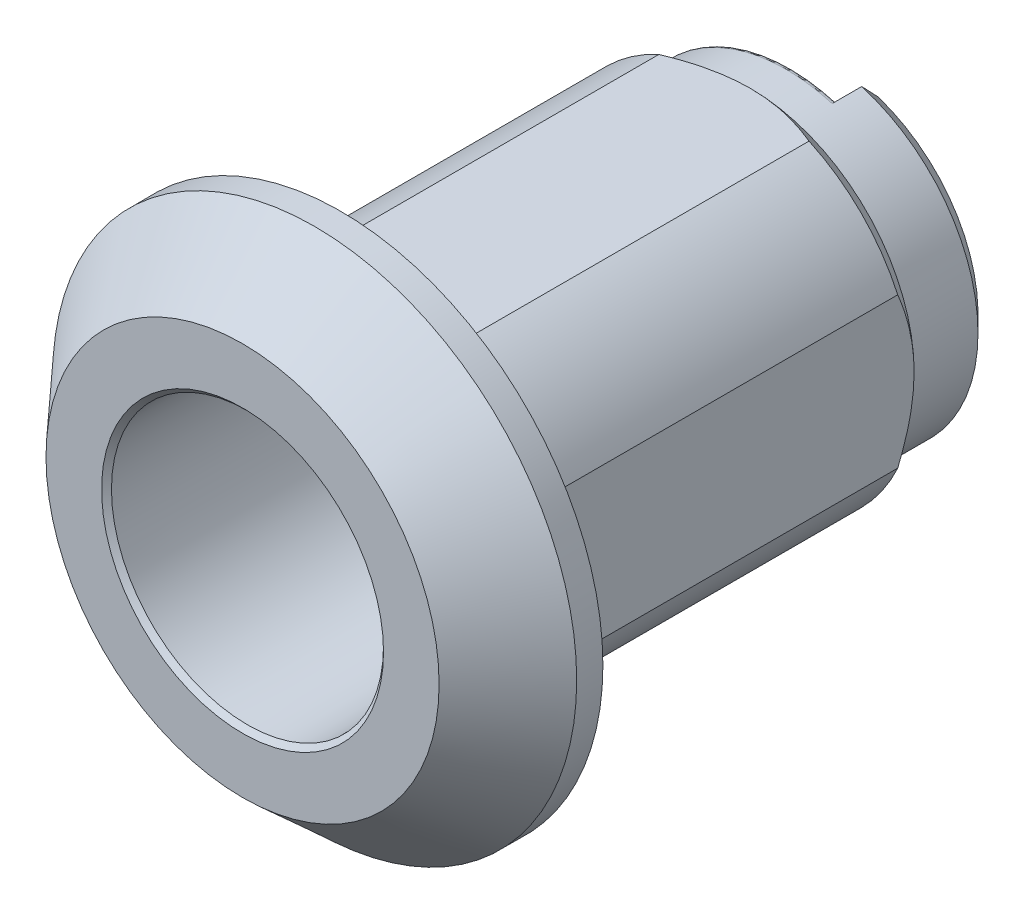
ISO-10303-21;
HEADER;
FILE_DESCRIPTION(('STEP AP214'),'2;1');
FILE_NAME('part.step','',(''),(''),'','','');
FILE_SCHEMA(('AUTOMOTIVE_DESIGN { 1 0 10303 214 1 1 1 1 }'));
ENDSEC;
DATA;
#1=APPLICATION_CONTEXT('core data for automotive mechanical design processes');
#2=APPLICATION_PROTOCOL_DEFINITION('international standard','automotive_design',2000,#1);
#3=PRODUCT_CONTEXT('',#1,'mechanical');
#4=PRODUCT('Part','Part','',(#3));
#5=PRODUCT_RELATED_PRODUCT_CATEGORY('part','',(#4));
#6=PRODUCT_DEFINITION_FORMATION('','',#4);
#7=PRODUCT_DEFINITION_CONTEXT('part definition',#1,'design');
#8=PRODUCT_DEFINITION('design','',#6,#7);
#9=PRODUCT_DEFINITION_SHAPE('','',#8);
#10=(LENGTH_UNIT() NAMED_UNIT(*) SI_UNIT(.MILLI.,.METRE.));
#11=(NAMED_UNIT(*) PLANE_ANGLE_UNIT() SI_UNIT($,.RADIAN.));
#12=(NAMED_UNIT(*) SI_UNIT($,.STERADIAN.) SOLID_ANGLE_UNIT());
#13=UNCERTAINTY_MEASURE_WITH_UNIT(LENGTH_MEASURE(1.E-05),#10,'distance_accuracy_value','');
#14=(GEOMETRIC_REPRESENTATION_CONTEXT(3) GLOBAL_UNCERTAINTY_ASSIGNED_CONTEXT((#13)) GLOBAL_UNIT_ASSIGNED_CONTEXT((#10,
#11,#12)) REPRESENTATION_CONTEXT('',''));
#15=CARTESIAN_POINT('',(0.,0.,0.));
#16=DIRECTION('',(0.,0.,1.));
#17=DIRECTION('',(1.,0.,0.));
#18=AXIS2_PLACEMENT_3D('',#15,#16,#17);
#19=CARTESIAN_POINT('',(-10.,10.,0.));
#20=DIRECTION('',(0.,-1.,0.));
#21=DIRECTION('',(0.,0.,-1.));
#22=AXIS2_PLACEMENT_3D('',#19,#20,#21);
#23=PLANE('',#22);
#24=DIRECTION('',(1.,0.,0.));
#25=VECTOR('',#24,1.);
#26=CARTESIAN_POINT('',(0.,10.0000000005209,0.));
#27=LINE('',#26,#25);
#28=CARTESIAN_POINT('',(-4.58257569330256,10.0000000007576,0.));
#29=VERTEX_POINT('',#28);
#30=CARTESIAN_POINT('',(4.58257569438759,10.0000000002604,0.));
#31=VERTEX_POINT('',#30);
#32=EDGE_CURVE('E194',#29,#31,#27,.T.);
#33=ORIENTED_EDGE('',*,*,#32,.T.);
#34=DIRECTION('',(0.,0.,-1.));
#35=VECTOR('',#34,1.);
#36=CARTESIAN_POINT('',(4.58257569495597,9.99999999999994,0.));
#37=LINE('',#36,#35);
#38=CARTESIAN_POINT('',(4.58257569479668,9.99999999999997,-23.9999999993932));
#39=VERTEX_POINT('',#38);
#40=EDGE_CURVE('E362',#39,#31,#37,.F.);
#41=ORIENTED_EDGE('',*,*,#40,.F.);
#42=CARTESIAN_POINT('',(0.,9.99999999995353,-25.0000000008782));
#43=CARTESIAN_POINT('',(0.153419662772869,9.99999999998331,-25.0000177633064));
#44=CARTESIAN_POINT('',(0.306833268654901,9.99999999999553,-24.9964698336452));
#45=CARTESIAN_POINT('',(0.613315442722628,10.0000000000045,-24.9823745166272));
#46=CARTESIAN_POINT('',(0.766384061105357,10.0000000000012,-24.9718282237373));
#47=CARTESIAN_POINT('',(1.07166096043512,9.9999999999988,-24.9438891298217));
#48=CARTESIAN_POINT('',(1.22387019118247,9.99999999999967,-24.9265066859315));
#49=CARTESIAN_POINT('',(1.52738320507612,10.0000000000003,-24.8851453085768));
#50=CARTESIAN_POINT('',(1.67868696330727,10.0000000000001,-24.8611661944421));
#51=CARTESIAN_POINT('',(2.12685071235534,9.99999999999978,-24.7805087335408));
#52=CARTESIAN_POINT('',(2.42210425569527,9.99999999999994,-24.7147147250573));
#53=CARTESIAN_POINT('',(3.0068849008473,10.0000000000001,-24.5615326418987));
#54=CARTESIAN_POINT('',(3.29641147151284,10.,-24.4741425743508));
#55=CARTESIAN_POINT('',(3.75125759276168,9.99999999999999,-24.3207320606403));
#56=CARTESIAN_POINT('',(3.91864293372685,10.,-24.2607244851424));
#57=CARTESIAN_POINT('',(4.25191341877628,10.,-24.1346928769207));
#58=CARTESIAN_POINT('',(4.41778971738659,10.,-24.0686454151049));
#59=CARTESIAN_POINT('',(4.58257569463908,10.,-23.9999999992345));
#60=B_SPLINE_CURVE_WITH_KNOTS('',3,(#42,#43,#44,#45,#46,#47,#48,#49,#50,#51,#52,#53,#54,#55,#56,
#57,#58,#59),.UNSPECIFIED.,.F.,.F.,(4,2,2,2,2,2,2,2,4),(0.,0.460207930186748,0.920343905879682,
1.37978541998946,1.83923951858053,2.74570852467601,3.65226121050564,4.18561484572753,
4.72113306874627),.UNSPECIFIED.);
#61=CARTESIAN_POINT('',(0.,10.0000000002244,-25.0000000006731));
#62=VERTEX_POINT('',#61);
#63=EDGE_CURVE('E368',#62,#39,#60,.T.);
#64=ORIENTED_EDGE('',*,*,#63,.F.);
#65=CARTESIAN_POINT('',(-4.5825756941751,10.,-23.9999999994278));
#66=CARTESIAN_POINT('',(-4.40028329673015,10.,-24.0759299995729));
#67=CARTESIAN_POINT('',(-4.21668434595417,10.,-24.1486818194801));
#68=CARTESIAN_POINT('',(-3.84668711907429,10.,-24.2870431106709));
#69=CARTESIAN_POINT('',(-3.66028713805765,10.,-24.3526480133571));
#70=CARTESIAN_POINT('',(-3.10086162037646,10.,-24.5361412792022));
#71=CARTESIAN_POINT('',(-2.7238190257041,10.,-24.6423213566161));
#72=CARTESIAN_POINT('',(-2.15145029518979,10.,-24.7728762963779));
#73=CARTESIAN_POINT('',(-1.95932775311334,10.,-24.8116334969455));
#74=CARTESIAN_POINT('',(-1.57326186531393,10.,-24.8787828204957));
#75=CARTESIAN_POINT('',(-1.37931860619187,10.,-24.9071754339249));
#76=CARTESIAN_POINT('',(-0.988206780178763,10.,-24.9531827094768));
#77=CARTESIAN_POINT('',(-0.79102528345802,10.,-24.9706880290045));
#78=CARTESIAN_POINT('',(-0.395902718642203,10.,-24.9941229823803));
#79=CARTESIAN_POINT('',(-0.197961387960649,10.,-25.0000481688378));
#80=CARTESIAN_POINT('',(-8.01719949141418E-12,10.,-25.0000000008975));
#81=B_SPLINE_CURVE_WITH_KNOTS('',3,(#65,#66,#67,#68,#69,#70,#71,#72,#73,#74,#75,#76,#77,#78,#79,
#80),.UNSPECIFIED.,.F.,.F.,(4,2,2,2,2,2,2,4),(0.,0.592342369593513,1.18506119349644,
2.35817128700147,2.94592281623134,3.53364652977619,4.1271813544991,4.72094408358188),.UNSPECIFIED.);
#82=CARTESIAN_POINT('',(-4.58257569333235,10.0000000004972,-23.9999999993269));
#83=VERTEX_POINT('',#82);
#84=EDGE_CURVE('E170',#83,#62,#81,.T.);
#85=ORIENTED_EDGE('',*,*,#84,.F.);
#86=DIRECTION('',(0.,0.,-1.));
#87=VECTOR('',#86,1.);
#88=CARTESIAN_POINT('',(-4.58257569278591,10.0000000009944,0.));
#89=LINE('',#88,#87);
#90=EDGE_CURVE('E155',#29,#83,#89,.T.);
#91=ORIENTED_EDGE('',*,*,#90,.F.);
#92=EDGE_LOOP('',(#33,#41,#64,#85,#91));
#93=FACE_BOUND('',#92,.T.);
#94=ADVANCED_FACE('F16',(#93),#23,.F.);
#95=CARTESIAN_POINT('',(0.,0.,0.));
#96=DIRECTION('',(0.,0.,-1.));
#97=DIRECTION('',(-1.,0.,0.));
#98=AXIS2_PLACEMENT_3D('',#95,#96,#97);
#99=CYLINDRICAL_SURFACE('',#98,11.);
#100=DIRECTION('',(0.,0.,1.));
#101=VECTOR('',#100,1.);
#102=CARTESIAN_POINT('',(10.,4.58257569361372,0.));
#103=LINE('',#102,#101);
#104=CARTESIAN_POINT('',(10.0000000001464,4.58257569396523,0.));
#105=VERTEX_POINT('',#104);
#106=CARTESIAN_POINT('',(10.,4.58257569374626,-23.9999999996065));
#107=VERTEX_POINT('',#106);
#108=EDGE_CURVE('E360',#105,#107,#103,.F.);
#109=ORIENTED_EDGE('',*,*,#108,.T.);
#110=CARTESIAN_POINT('',(0.,0.,-23.9999999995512));
#111=DIRECTION('',(0.,0.,1.));
#112=DIRECTION('',(-1.,0.,0.));
#113=AXIS2_PLACEMENT_3D('',#110,#111,#112);
#114=CIRCLE('',#113,10.9999999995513);
#115=EDGE_CURVE('E366',#39,#107,#114,.F.);
#116=ORIENTED_EDGE('',*,*,#115,.F.);
#117=ORIENTED_EDGE('',*,*,#40,.T.);
#118=CARTESIAN_POINT('',(0.,0.,0.));
#119=DIRECTION('',(0.,0.,-1.));
#120=DIRECTION('',(-1.,0.,0.));
#121=AXIS2_PLACEMENT_3D('',#118,#119,#120);
#122=CIRCLE('',#121,11.);
#123=EDGE_CURVE('E191',#31,#105,#122,.T.);
#124=ORIENTED_EDGE('',*,*,#123,.T.);
#125=EDGE_LOOP('',(#109,#116,#117,#124));
#126=FACE_BOUND('',#125,.T.);
#127=ADVANCED_FACE('F243',(#126),#99,.T.);
#128=CARTESIAN_POINT('',(10.,10.,0.));
#129=DIRECTION('',(-1.,0.,0.));
#130=DIRECTION('',(0.,0.,1.));
#131=AXIS2_PLACEMENT_3D('',#128,#129,#130);
#132=PLANE('',#131);
#133=CARTESIAN_POINT('',(9.99999999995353,0.,-25.0000000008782));
#134=CARTESIAN_POINT('',(9.99999999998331,-0.153419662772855,-25.0000177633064));
#135=CARTESIAN_POINT('',(9.99999999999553,-0.306833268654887,-24.9964698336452));
#136=CARTESIAN_POINT('',(10.0000000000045,-0.613315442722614,-24.9823745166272));
#137=CARTESIAN_POINT('',(10.0000000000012,-0.766384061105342,-24.9718282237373));
#138=CARTESIAN_POINT('',(9.9999999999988,-1.07166096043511,-24.9438891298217));
#139=CARTESIAN_POINT('',(9.99999999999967,-1.22387019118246,-24.9265066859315));
#140=CARTESIAN_POINT('',(10.0000000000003,-1.52738320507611,-24.8851453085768));
#141=CARTESIAN_POINT('',(10.0000000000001,-1.67868696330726,-24.8611661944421));
#142=CARTESIAN_POINT('',(9.99999999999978,-2.12685071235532,-24.7805087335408));
#143=CARTESIAN_POINT('',(9.99999999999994,-2.42210425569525,-24.7147147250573));
#144=CARTESIAN_POINT('',(10.0000000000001,-3.00688490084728,-24.5615326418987));
#145=CARTESIAN_POINT('',(10.,-3.29641147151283,-24.4741425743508));
#146=CARTESIAN_POINT('',(9.99999999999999,-3.75125759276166,-24.3207320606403));
#147=CARTESIAN_POINT('',(10.,-3.91864293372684,-24.2607244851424));
#148=CARTESIAN_POINT('',(10.,-4.25191341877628,-24.1346928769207));
#149=CARTESIAN_POINT('',(10.,-4.41778971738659,-24.0686454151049));
#150=CARTESIAN_POINT('',(10.,-4.58257569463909,-23.9999999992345));
#151=B_SPLINE_CURVE_WITH_KNOTS('',3,(#133,#134,#135,#136,#137,#138,#139,#140,#141,#142,#143,
#144,#145,#146,#147,#148,#149,#150),.UNSPECIFIED.,.F.,.F.,(4,2,2,2,2,2,2,2,4),(0.,
0.460207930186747,0.920343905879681,1.37978541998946,1.83923951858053,2.74570852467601,
3.65226121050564,4.18561484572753,4.72113306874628),.UNSPECIFIED.);
#152=CARTESIAN_POINT('',(10.0000000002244,0.,-25.0000000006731));
#153=VERTEX_POINT('',#152);
#154=CARTESIAN_POINT('',(9.99999999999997,-4.58257569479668,-23.9999999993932));
#155=VERTEX_POINT('',#154);
#156=EDGE_CURVE('E227',#153,#155,#151,.T.);
#157=ORIENTED_EDGE('',*,*,#156,.F.);
#158=CARTESIAN_POINT('',(10.0000000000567,4.58257569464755,-23.9999999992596));
#159=CARTESIAN_POINT('',(10.0000000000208,4.40028329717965,-24.0759299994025));
#160=CARTESIAN_POINT('',(10.0000000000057,4.21668434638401,-24.1486818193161));
#161=CARTESIAN_POINT('',(9.99999999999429,3.84668711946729,-24.2870431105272));
#162=CARTESIAN_POINT('',(9.99999999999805,3.66028713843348,-24.3526480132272));
#163=CARTESIAN_POINT('',(10.0000000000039,3.10086162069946,-24.5361412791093));
#164=CARTESIAN_POINT('',(10.0000000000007,2.72381902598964,-24.6423213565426));
#165=CARTESIAN_POINT('',(9.99999999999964,2.15145029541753,-24.7728762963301));
#166=CARTESIAN_POINT('',(9.9999999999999,1.95932775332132,-24.8116334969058));
#167=CARTESIAN_POINT('',(10.0000000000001,1.57326186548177,-24.87878282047));
#168=CARTESIAN_POINT('',(10.,1.37931860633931,-24.9071754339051));
#169=CARTESIAN_POINT('',(9.99999999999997,0.988206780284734,-24.9531827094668));
#170=CARTESIAN_POINT('',(9.99999999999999,0.791025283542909,-24.9706880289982));
#171=CARTESIAN_POINT('',(10.,0.395902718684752,-24.994122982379));
#172=CARTESIAN_POINT('',(10.,0.197961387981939,-25.0000481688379));
#173=CARTESIAN_POINT('',(10.,8.03184633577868E-12,-25.0000000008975));
#174=B_SPLINE_CURVE_WITH_KNOTS('',3,(#158,#159,#160,#161,#162,#163,#164,#165,#166,#167,#168,
#169,#170,#171,#172,#173),.UNSPECIFIED.,.F.,.F.,(4,2,2,2,2,2,2,4),(0.,0.592342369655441,
1.18506119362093,2.35817128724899,2.94592281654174,3.5336465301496,4.1271813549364,
4.72094408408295),.UNSPECIFIED.);
#175=EDGE_CURVE('E234',#107,#153,#174,.T.);
#176=ORIENTED_EDGE('',*,*,#175,.F.);
#177=ORIENTED_EDGE('',*,*,#108,.F.);
#178=DIRECTION('',(0.,1.,0.));
#179=VECTOR('',#178,1.);
#180=CARTESIAN_POINT('',(10.0000000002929,0.,0.));
#181=LINE('',#180,#179);
#182=CARTESIAN_POINT('',(10.0000000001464,-4.58257569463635,0.));
#183=VERTEX_POINT('',#182);
#184=EDGE_CURVE('E190',#105,#183,#181,.F.);
#185=ORIENTED_EDGE('',*,*,#184,.T.);
#186=DIRECTION('',(0.,0.,-1.));
#187=VECTOR('',#186,1.);
#188=CARTESIAN_POINT('',(9.99999999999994,-4.58257569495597,0.));
#189=LINE('',#188,#187);
#190=EDGE_CURVE('E358',#155,#183,#189,.F.);
#191=ORIENTED_EDGE('',*,*,#190,.F.);
#192=EDGE_LOOP('',(#157,#176,#177,#185,#191));
#193=FACE_BOUND('',#192,.T.);
#194=ADVANCED_FACE('F239',(#193),#132,.F.);
#195=CARTESIAN_POINT('',(0.,0.,0.));
#196=DIRECTION('',(0.,0.,-1.));
#197=DIRECTION('',(-1.,0.,0.));
#198=AXIS2_PLACEMENT_3D('',#195,#196,#197);
#199=CYLINDRICAL_SURFACE('',#198,11.);
#200=DIRECTION('',(0.,0.,1.));
#201=VECTOR('',#200,1.);
#202=CARTESIAN_POINT('',(4.58257569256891,-10.,0.));
#203=LINE('',#202,#201);
#204=CARTESIAN_POINT('',(4.58257569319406,-10.0000000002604,0.));
#205=VERTEX_POINT('',#204);
#206=CARTESIAN_POINT('',(4.58257569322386,-10.,-23.9999999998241));
#207=VERTEX_POINT('',#206);
#208=EDGE_CURVE('E355',#205,#207,#203,.F.);
#209=ORIENTED_EDGE('',*,*,#208,.T.);
#210=CARTESIAN_POINT('',(0.,0.,-23.9999999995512));
#211=DIRECTION('',(0.,0.,1.));
#212=DIRECTION('',(-1.,0.,0.));
#213=AXIS2_PLACEMENT_3D('',#210,#211,#212);
#214=CIRCLE('',#213,10.9999999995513);
#215=EDGE_CURVE('E233',#155,#207,#214,.F.);
#216=ORIENTED_EDGE('',*,*,#215,.F.);
#217=ORIENTED_EDGE('',*,*,#190,.T.);
#218=CARTESIAN_POINT('',(0.,0.,0.));
#219=DIRECTION('',(0.,0.,-1.));
#220=DIRECTION('',(-1.,0.,0.));
#221=AXIS2_PLACEMENT_3D('',#218,#219,#220);
#222=CIRCLE('',#221,11.);
#223=EDGE_CURVE('E187',#183,#205,#222,.T.);
#224=ORIENTED_EDGE('',*,*,#223,.T.);
#225=EDGE_LOOP('',(#209,#216,#217,#224));
#226=FACE_BOUND('',#225,.T.);
#227=ADVANCED_FACE('F242',(#226),#199,.T.);
#228=CARTESIAN_POINT('',(10.,-10.,0.));
#229=DIRECTION('',(0.,1.,0.));
#230=DIRECTION('',(0.,0.,1.));
#231=AXIS2_PLACEMENT_3D('',#228,#229,#230);
#232=PLANE('',#231);
#233=DIRECTION('',(1.,0.,0.));
#234=VECTOR('',#233,1.);
#235=CARTESIAN_POINT('',(0.,-10.0000000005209,0.));
#236=LINE('',#235,#234);
#237=CARTESIAN_POINT('',(-4.58257569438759,-10.0000000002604,0.));
#238=VERTEX_POINT('',#237);
#239=EDGE_CURVE('E186',#205,#238,#236,.F.);
#240=ORIENTED_EDGE('',*,*,#239,.T.);
#241=DIRECTION('',(0.,0.,-1.));
#242=VECTOR('',#241,1.);
#243=CARTESIAN_POINT('',(-4.58257569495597,-9.99999999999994,0.));
#244=LINE('',#243,#242);
#245=CARTESIAN_POINT('',(-4.58257569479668,-9.99999999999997,-23.9999999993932));
#246=VERTEX_POINT('',#245);
#247=EDGE_CURVE('E353',#246,#238,#244,.F.);
#248=ORIENTED_EDGE('',*,*,#247,.F.);
#249=CARTESIAN_POINT('',(0.,-9.99999999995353,-25.0000000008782));
#250=CARTESIAN_POINT('',(-0.153419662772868,-9.99999999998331,-25.0000177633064));
#251=CARTESIAN_POINT('',(-0.306833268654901,-9.99999999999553,-24.9964698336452));
#252=CARTESIAN_POINT('',(-0.613315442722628,-10.0000000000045,-24.9823745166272));
#253=CARTESIAN_POINT('',(-0.766384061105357,-10.0000000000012,-24.9718282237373));
#254=CARTESIAN_POINT('',(-1.07166096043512,-9.9999999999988,-24.9438891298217));
#255=CARTESIAN_POINT('',(-1.22387019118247,-9.99999999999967,-24.9265066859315));
#256=CARTESIAN_POINT('',(-1.52738320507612,-10.0000000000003,-24.8851453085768));
#257=CARTESIAN_POINT('',(-1.67868696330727,-10.0000000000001,-24.8611661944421));
#258=CARTESIAN_POINT('',(-2.12685071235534,-9.99999999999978,-24.7805087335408));
#259=CARTESIAN_POINT('',(-2.42210425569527,-9.99999999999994,-24.7147147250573));
#260=CARTESIAN_POINT('',(-3.0068849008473,-10.0000000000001,-24.5615326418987));
#261=CARTESIAN_POINT('',(-3.29641147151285,-10.,-24.4741425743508));
#262=CARTESIAN_POINT('',(-3.75125759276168,-9.99999999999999,-24.3207320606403));
#263=CARTESIAN_POINT('',(-3.91864293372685,-10.,-24.2607244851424));
#264=CARTESIAN_POINT('',(-4.25191341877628,-10.,-24.1346928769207));
#265=CARTESIAN_POINT('',(-4.41778971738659,-10.,-24.0686454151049));
#266=CARTESIAN_POINT('',(-4.58257569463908,-10.,-23.9999999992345));
#267=B_SPLINE_CURVE_WITH_KNOTS('',3,(#249,#250,#251,#252,#253,#254,#255,#256,#257,#258,#259,
#260,#261,#262,#263,#264,#265,#266),.UNSPECIFIED.,.F.,.F.,(4,2,2,2,2,2,2,2,4),(0.,
0.460207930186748,0.920343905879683,1.37978541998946,1.83923951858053,2.74570852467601,
3.65226121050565,4.18561484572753,4.72113306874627),.UNSPECIFIED.);
#268=CARTESIAN_POINT('',(0.,-10.0000000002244,-25.0000000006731));
#269=VERTEX_POINT('',#268);
#270=EDGE_CURVE('E142',#269,#246,#267,.T.);
#271=ORIENTED_EDGE('',*,*,#270,.F.);
#272=CARTESIAN_POINT('',(4.58257569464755,-10.0000000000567,-23.9999999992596));
#273=CARTESIAN_POINT('',(4.40028329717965,-10.0000000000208,-24.0759299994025));
#274=CARTESIAN_POINT('',(4.21668434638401,-10.0000000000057,-24.1486818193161));
#275=CARTESIAN_POINT('',(3.84668711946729,-9.99999999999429,-24.2870431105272));
#276=CARTESIAN_POINT('',(3.66028713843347,-9.99999999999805,-24.3526480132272));
#277=CARTESIAN_POINT('',(3.10086162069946,-10.0000000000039,-24.5361412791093));
#278=CARTESIAN_POINT('',(2.72381902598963,-10.0000000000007,-24.6423213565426));
#279=CARTESIAN_POINT('',(2.15145029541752,-9.99999999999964,-24.7728762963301));
#280=CARTESIAN_POINT('',(1.95932775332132,-9.9999999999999,-24.8116334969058));
#281=CARTESIAN_POINT('',(1.57326186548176,-10.0000000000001,-24.87878282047));
#282=CARTESIAN_POINT('',(1.3793186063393,-10.,-24.9071754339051));
#283=CARTESIAN_POINT('',(0.988206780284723,-9.99999999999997,-24.9531827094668));
#284=CARTESIAN_POINT('',(0.791025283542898,-9.99999999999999,-24.9706880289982));
#285=CARTESIAN_POINT('',(0.39590271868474,-10.,-24.994122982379));
#286=CARTESIAN_POINT('',(0.197961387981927,-10.,-25.0000481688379));
#287=CARTESIAN_POINT('',(8.01910653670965E-12,-10.,-25.0000000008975));
#288=B_SPLINE_CURVE_WITH_KNOTS('',3,(#272,#273,#274,#275,#276,#277,#278,#279,#280,#281,#282,
#283,#284,#285,#286,#287),.UNSPECIFIED.,.F.,.F.,(4,2,2,2,2,2,2,4),(0.,0.592342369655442,
1.18506119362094,2.358171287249,2.94592281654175,3.53364653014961,4.12718135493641,
4.72094408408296),.UNSPECIFIED.);
#289=EDGE_CURVE('E143',#207,#269,#288,.T.);
#290=ORIENTED_EDGE('',*,*,#289,.F.);
#291=ORIENTED_EDGE('',*,*,#208,.F.);
#292=EDGE_LOOP('',(#240,#248,#271,#290,#291));
#293=FACE_BOUND('',#292,.T.);
#294=ADVANCED_FACE('F204',(#293),#232,.F.);
#295=CARTESIAN_POINT('',(0.,0.,0.));
#296=DIRECTION('',(0.,0.,-1.));
#297=DIRECTION('',(-1.,0.,0.));
#298=AXIS2_PLACEMENT_3D('',#295,#296,#297);
#299=CYLINDRICAL_SURFACE('',#298,11.);
#300=ORIENTED_EDGE('',*,*,#247,.T.);
#301=CARTESIAN_POINT('',(0.,0.,0.));
#302=DIRECTION('',(0.,0.,-1.));
#303=DIRECTION('',(-1.,0.,0.));
#304=AXIS2_PLACEMENT_3D('',#301,#302,#303);
#305=CIRCLE('',#304,11.);
#306=CARTESIAN_POINT('',(-10.0000000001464,-4.58257569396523,0.));
#307=VERTEX_POINT('',#306);
#308=EDGE_CURVE('E183',#238,#307,#305,.T.);
#309=ORIENTED_EDGE('',*,*,#308,.T.);
#310=DIRECTION('',(0.,0.,-1.));
#311=VECTOR('',#310,1.);
#312=CARTESIAN_POINT('',(-10.,-4.58257569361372,0.));
#313=LINE('',#312,#311);
#314=CARTESIAN_POINT('',(-10.,-4.58257569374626,-23.9999999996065));
#315=VERTEX_POINT('',#314);
#316=EDGE_CURVE('E350',#307,#315,#313,.T.);
#317=ORIENTED_EDGE('',*,*,#316,.T.);
#318=CARTESIAN_POINT('',(0.,0.,-23.9999999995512));
#319=DIRECTION('',(0.,0.,1.));
#320=DIRECTION('',(-1.,0.,0.));
#321=AXIS2_PLACEMENT_3D('',#318,#319,#320);
#322=CIRCLE('',#321,10.9999999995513);
#323=EDGE_CURVE('E140',#246,#315,#322,.F.);
#324=ORIENTED_EDGE('',*,*,#323,.F.);
#325=EDGE_LOOP('',(#300,#309,#317,#324));
#326=FACE_BOUND('',#325,.T.);
#327=ADVANCED_FACE('F561',(#326),#299,.T.);
#328=CARTESIAN_POINT('',(-10.,-10.,0.));
#329=DIRECTION('',(1.,0.,0.));
#330=DIRECTION('',(0.,0.,-1.));
#331=AXIS2_PLACEMENT_3D('',#328,#329,#330);
#332=PLANE('',#331);
#333=DIRECTION('',(0.,1.,0.));
#334=VECTOR('',#333,1.);
#335=CARTESIAN_POINT('',(-10.0000000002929,0.,0.));
#336=LINE('',#335,#334);
#337=CARTESIAN_POINT('',(-10.0000000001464,4.58257569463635,0.));
#338=VERTEX_POINT('',#337);
#339=EDGE_CURVE('E182',#307,#338,#336,.T.);
#340=ORIENTED_EDGE('',*,*,#339,.T.);
#341=DIRECTION('',(0.,0.,-1.));
#342=VECTOR('',#341,1.);
#343=CARTESIAN_POINT('',(-9.99999999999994,4.58257569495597,0.));
#344=LINE('',#343,#342);
#345=CARTESIAN_POINT('',(-9.99999999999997,4.58257569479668,-23.9999999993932));
#346=VERTEX_POINT('',#345);
#347=EDGE_CURVE('E149',#346,#338,#344,.F.);
#348=ORIENTED_EDGE('',*,*,#347,.F.);
#349=CARTESIAN_POINT('',(-9.99999999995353,0.,-25.0000000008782));
#350=CARTESIAN_POINT('',(-9.99999999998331,0.153419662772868,-25.0000177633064));
#351=CARTESIAN_POINT('',(-9.99999999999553,0.3068332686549,-24.9964698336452));
#352=CARTESIAN_POINT('',(-10.0000000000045,0.613315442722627,-24.9823745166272));
#353=CARTESIAN_POINT('',(-10.0000000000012,0.766384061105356,-24.9718282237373));
#354=CARTESIAN_POINT('',(-9.9999999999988,1.07166096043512,-24.9438891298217));
#355=CARTESIAN_POINT('',(-9.99999999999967,1.22387019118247,-24.9265066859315));
#356=CARTESIAN_POINT('',(-10.0000000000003,1.52738320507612,-24.8851453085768));
#357=CARTESIAN_POINT('',(-10.0000000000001,1.67868696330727,-24.8611661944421));
#358=CARTESIAN_POINT('',(-9.99999999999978,2.12685071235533,-24.7805087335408));
#359=CARTESIAN_POINT('',(-9.99999999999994,2.42210425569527,-24.7147147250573));
#360=CARTESIAN_POINT('',(-10.0000000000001,3.00688490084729,-24.5615326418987));
#361=CARTESIAN_POINT('',(-10.,3.29641147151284,-24.4741425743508));
#362=CARTESIAN_POINT('',(-9.99999999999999,3.75125759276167,-24.3207320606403));
#363=CARTESIAN_POINT('',(-10.,3.91864293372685,-24.2607244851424));
#364=CARTESIAN_POINT('',(-10.,4.25191341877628,-24.1346928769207));
#365=CARTESIAN_POINT('',(-10.,4.41778971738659,-24.0686454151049));
#366=CARTESIAN_POINT('',(-10.,4.58257569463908,-23.9999999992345));
#367=B_SPLINE_CURVE_WITH_KNOTS('',3,(#349,#350,#351,#352,#353,#354,#355,#356,#357,#358,#359,
#360,#361,#362,#363,#364,#365,#366),.UNSPECIFIED.,.F.,.F.,(4,2,2,2,2,2,2,2,4),(0.,
0.460207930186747,0.920343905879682,1.37978541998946,1.83923951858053,2.74570852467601,
3.65226121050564,4.18561484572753,4.72113306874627),.UNSPECIFIED.);
#368=CARTESIAN_POINT('',(-10.0000000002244,0.,-25.0000000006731));
#369=VERTEX_POINT('',#368);
#370=EDGE_CURVE('E20',#369,#346,#367,.T.);
#371=ORIENTED_EDGE('',*,*,#370,.F.);
#372=CARTESIAN_POINT('',(-10.0000000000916,-4.58257569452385,-23.9999999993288));
#373=CARTESIAN_POINT('',(-10.0000000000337,-4.40028329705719,-24.0759299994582));
#374=CARTESIAN_POINT('',(-10.0000000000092,-4.21668434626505,-24.1486818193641));
#375=CARTESIAN_POINT('',(-9.99999999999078,-3.84668711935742,-24.2870431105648));
#376=CARTESIAN_POINT('',(-9.99999999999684,-3.66028713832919,-24.3526480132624));
#377=CARTESIAN_POINT('',(-10.0000000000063,-3.10086162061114,-24.5361412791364));
#378=CARTESIAN_POINT('',(-10.0000000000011,-2.72381902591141,-24.642321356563));
#379=CARTESIAN_POINT('',(-9.99999999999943,-2.1514502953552,-24.772876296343));
#380=CARTESIAN_POINT('',(-9.99999999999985,-1.95932775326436,-24.8116334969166));
#381=CARTESIAN_POINT('',(-10.0000000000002,-1.5732618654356,-24.8787828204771));
#382=CARTESIAN_POINT('',(-10.,-1.37931860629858,-24.9071754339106));
#383=CARTESIAN_POINT('',(-9.99999999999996,-0.988206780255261,-24.9531827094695));
#384=CARTESIAN_POINT('',(-9.99999999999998,-0.791025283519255,-24.970688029));
#385=CARTESIAN_POINT('',(-10.,-0.395902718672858,-24.9941229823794));
#386=CARTESIAN_POINT('',(-10.,-0.197961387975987,-25.0000481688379));
#387=CARTESIAN_POINT('',(-10.,-8.01706497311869E-12,-25.0000000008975));
#388=B_SPLINE_CURVE_WITH_KNOTS('',3,(#372,#373,#374,#375,#376,#377,#378,#379,#380,#381,#382,
#383,#384,#385,#386,#387),.UNSPECIFIED.,.F.,.F.,(4,2,2,2,2,2,2,4),(0.,0.592342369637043,
1.18506119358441,2.3581712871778,2.9459228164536,3.53364653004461,4.12718135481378,
4.72094408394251),.UNSPECIFIED.);
#389=EDGE_CURVE('E134',#315,#369,#388,.T.);
#390=ORIENTED_EDGE('',*,*,#389,.F.);
#391=ORIENTED_EDGE('',*,*,#316,.F.);
#392=EDGE_LOOP('',(#340,#348,#371,#390,#391));
#393=FACE_BOUND('',#392,.T.);
#394=ADVANCED_FACE('F148',(#393),#332,.F.);
#395=CARTESIAN_POINT('',(0.,0.,0.));
#396=DIRECTION('',(0.,0.,-1.));
#397=DIRECTION('',(-1.,0.,0.));
#398=AXIS2_PLACEMENT_3D('',#395,#396,#397);
#399=CYLINDRICAL_SURFACE('',#398,11.);
#400=ORIENTED_EDGE('',*,*,#90,.T.);
#401=CARTESIAN_POINT('',(0.,0.,-23.9999999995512));
#402=DIRECTION('',(0.,0.,1.));
#403=DIRECTION('',(-1.,0.,0.));
#404=AXIS2_PLACEMENT_3D('',#401,#402,#403);
#405=CIRCLE('',#404,10.9999999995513);
#406=EDGE_CURVE('E154',#346,#83,#405,.F.);
#407=ORIENTED_EDGE('',*,*,#406,.F.);
#408=ORIENTED_EDGE('',*,*,#347,.T.);
#409=CARTESIAN_POINT('',(0.,0.,0.));
#410=DIRECTION('',(0.,0.,-1.));
#411=DIRECTION('',(-1.,0.,0.));
#412=AXIS2_PLACEMENT_3D('',#409,#410,#411);
#413=CIRCLE('',#412,11.);
#414=EDGE_CURVE('E176',#338,#29,#413,.T.);
#415=ORIENTED_EDGE('',*,*,#414,.T.);
#416=EDGE_LOOP('',(#400,#407,#408,#415));
#417=FACE_BOUND('',#416,.T.);
#418=ADVANCED_FACE('F578',(#417),#399,.T.);
#419=CARTESIAN_POINT('',(0.,0.,-23.9999999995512));
#420=DIRECTION('',(0.,0.,1.));
#421=DIRECTION('',(1.,0.,0.));
#422=AXIS2_PLACEMENT_3D('',#419,#420,#421);
#423=CONICAL_SURFACE('',#422,10.9999999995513,0.7853981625);
#424=ORIENTED_EDGE('',*,*,#84,.T.);
#425=CARTESIAN_POINT('',(0.,0.,-25.0000000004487));
#426=DIRECTION('',(0.,0.,1.));
#427=DIRECTION('',(1.,0.,0.));
#428=AXIS2_PLACEMENT_3D('',#425,#426,#427);
#429=CIRCLE('',#428,10.0000000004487);
#430=EDGE_CURVE('E161',#369,#62,#429,.F.);
#431=ORIENTED_EDGE('',*,*,#430,.F.);
#432=ORIENTED_EDGE('',*,*,#370,.T.);
#433=ORIENTED_EDGE('',*,*,#406,.T.);
#434=EDGE_LOOP('',(#424,#431,#432,#433));
#435=FACE_BOUND('',#434,.T.);
#436=ADVANCED_FACE('F168',(#435),#423,.T.);
#437=CARTESIAN_POINT('',(0.,0.,-23.9999999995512));
#438=DIRECTION('',(0.,0.,1.));
#439=DIRECTION('',(1.,0.,0.));
#440=AXIS2_PLACEMENT_3D('',#437,#438,#439);
#441=CONICAL_SURFACE('',#440,10.9999999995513,0.7853981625);
#442=ORIENTED_EDGE('',*,*,#175,.T.);
#443=CARTESIAN_POINT('',(0.,0.,-25.0000000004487));
#444=DIRECTION('',(0.,0.,1.));
#445=DIRECTION('',(1.,0.,0.));
#446=AXIS2_PLACEMENT_3D('',#443,#444,#445);
#447=CIRCLE('',#446,10.0000000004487);
#448=EDGE_CURVE('E171',#62,#153,#447,.F.);
#449=ORIENTED_EDGE('',*,*,#448,.F.);
#450=ORIENTED_EDGE('',*,*,#63,.T.);
#451=ORIENTED_EDGE('',*,*,#115,.T.);
#452=EDGE_LOOP('',(#442,#449,#450,#451));
#453=FACE_BOUND('',#452,.T.);
#454=ADVANCED_FACE('F219',(#453),#441,.T.);
#455=CARTESIAN_POINT('',(0.,0.,-23.9999999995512));
#456=DIRECTION('',(0.,0.,1.));
#457=DIRECTION('',(1.,0.,0.));
#458=AXIS2_PLACEMENT_3D('',#455,#456,#457);
#459=CONICAL_SURFACE('',#458,10.9999999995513,0.7853981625);
#460=ORIENTED_EDGE('',*,*,#289,.T.);
#461=CARTESIAN_POINT('',(0.,0.,-25.0000000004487));
#462=DIRECTION('',(0.,0.,1.));
#463=DIRECTION('',(1.,0.,0.));
#464=AXIS2_PLACEMENT_3D('',#461,#462,#463);
#465=CIRCLE('',#464,10.0000000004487);
#466=EDGE_CURVE('E164',#153,#269,#465,.F.);
#467=ORIENTED_EDGE('',*,*,#466,.F.);
#468=ORIENTED_EDGE('',*,*,#156,.T.);
#469=ORIENTED_EDGE('',*,*,#215,.T.);
#470=EDGE_LOOP('',(#460,#467,#468,#469));
#471=FACE_BOUND('',#470,.T.);
#472=ADVANCED_FACE('F213',(#471),#459,.T.);
#473=CARTESIAN_POINT('',(0.,0.,-23.9999999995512));
#474=DIRECTION('',(0.,0.,1.));
#475=DIRECTION('',(1.,0.,0.));
#476=AXIS2_PLACEMENT_3D('',#473,#474,#475);
#477=CONICAL_SURFACE('',#476,10.9999999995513,0.7853981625);
#478=ORIENTED_EDGE('',*,*,#270,.T.);
#479=ORIENTED_EDGE('',*,*,#323,.T.);
#480=ORIENTED_EDGE('',*,*,#389,.T.);
#481=CARTESIAN_POINT('',(0.,0.,-25.0000000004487));
#482=DIRECTION('',(0.,0.,1.));
#483=DIRECTION('',(1.,0.,0.));
#484=AXIS2_PLACEMENT_3D('',#481,#482,#483);
#485=CIRCLE('',#484,10.0000000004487);
#486=EDGE_CURVE('E138',#269,#369,#485,.F.);
#487=ORIENTED_EDGE('',*,*,#486,.F.);
#488=EDGE_LOOP('',(#478,#479,#480,#487));
#489=FACE_BOUND('',#488,.T.);
#490=ADVANCED_FACE('F136',(#489),#477,.T.);
#491=CARTESIAN_POINT('',(0.,0.,0.));
#492=DIRECTION('',(0.,0.,1.));
#493=DIRECTION('',(1.,0.,0.));
#494=AXIS2_PLACEMENT_3D('',#491,#492,#493);
#495=PLANE('',#494);
#496=ORIENTED_EDGE('',*,*,#339,.F.);
#497=ORIENTED_EDGE('',*,*,#308,.F.);
#498=ORIENTED_EDGE('',*,*,#239,.F.);
#499=ORIENTED_EDGE('',*,*,#223,.F.);
#500=ORIENTED_EDGE('',*,*,#184,.F.);
#501=ORIENTED_EDGE('',*,*,#123,.F.);
#502=ORIENTED_EDGE('',*,*,#32,.F.);
#503=ORIENTED_EDGE('',*,*,#414,.F.);
#504=EDGE_LOOP('',(#496,#497,#498,#499,#500,#501,#502,#503));
#505=FACE_BOUND('',#504,.T.);
#506=CARTESIAN_POINT('',(0.,0.,0.));
#507=DIRECTION('',(0.,0.,1.));
#508=DIRECTION('',(1.,0.,0.));
#509=AXIS2_PLACEMENT_3D('',#506,#507,#508);
#510=CIRCLE('',#509,16.);
#511=CARTESIAN_POINT('',(16.,0.,0.));
#512=VERTEX_POINT('',#511);
#513=EDGE_CURVE('E166',#512,#512,#510,.T.);
#514=ORIENTED_EDGE('',*,*,#513,.F.);
#515=EDGE_LOOP('',(#514));
#516=FACE_BOUND('',#515,.T.);
#517=ADVANCED_FACE('F212',(#505,#516),#495,.F.);
#518=CARTESIAN_POINT('',(0.,0.,-27.2));
#519=DIRECTION('',(0.,0.,-1.));
#520=DIRECTION('',(-1.,0.,0.));
#521=AXIS2_PLACEMENT_3D('',#518,#519,#520);
#522=PLANE('',#521);
#523=DIRECTION('',(1.,0.,0.));
#524=VECTOR('',#523,1.);
#525=CARTESIAN_POINT('',(-2.,8.8,-27.2));
#526=LINE('',#525,#524);
#527=CARTESIAN_POINT('',(-1.99999999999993,8.80000000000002,-27.2));
#528=VERTEX_POINT('',#527);
#529=CARTESIAN_POINT('',(0.5681301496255,8.8,-27.2));
#530=VERTEX_POINT('',#529);
#531=EDGE_CURVE('E531',#528,#530,#526,.T.);
#532=ORIENTED_EDGE('',*,*,#531,.T.);
#533=DIRECTION('',(-0.258819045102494,0.965925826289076,0.));
#534=VECTOR('',#533,1.);
#535=CARTESIAN_POINT('',(0.5681301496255,8.8,-27.2));
#536=LINE('',#535,#534);
#537=CARTESIAN_POINT('',(0.675497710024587,8.399298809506,-27.2));
#538=VERTEX_POINT('',#537);
#539=EDGE_CURVE('E536',#530,#538,#536,.F.);
#540=ORIENTED_EDGE('',*,*,#539,.T.);
#541=DIRECTION('',(1.,0.,0.));
#542=VECTOR('',#541,1.);
#543=CARTESIAN_POINT('',(0.6754977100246,8.399298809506,-27.2));
#544=LINE('',#543,#542);
#545=CARTESIAN_POINT('',(-1.464610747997,8.399298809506,-27.2));
#546=VERTEX_POINT('',#545);
#547=EDGE_CURVE('E326',#538,#546,#544,.F.);
#548=ORIENTED_EDGE('',*,*,#547,.T.);
#549=DIRECTION('',(0.258819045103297,-0.96592582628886,0.));
#550=VECTOR('',#549,1.);
#551=CARTESIAN_POINT('',(-1.464610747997,8.399298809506,-27.2));
#552=LINE('',#551,#550);
#553=CARTESIAN_POINT('',(-1.17829724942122,7.33076228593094,-27.2));
#554=VERTEX_POINT('',#553);
#555=EDGE_CURVE('E172',#546,#554,#552,.T.);
#556=ORIENTED_EDGE('',*,*,#555,.T.);
#557=DIRECTION('',(1.,0.,0.));
#558=VECTOR('',#557,1.);
#559=CARTESIAN_POINT('',(-1.178297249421,7.330762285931,-27.2));
#560=LINE('',#559,#558);
#561=CARTESIAN_POINT('',(0.6764634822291,7.330762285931,-27.2));
#562=VERTEX_POINT('',#561);
#563=EDGE_CURVE('E483',#554,#562,#560,.T.);
#564=ORIENTED_EDGE('',*,*,#563,.T.);
#565=DIRECTION('',(-0.258819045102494,0.965925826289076,0.));
#566=VECTOR('',#565,1.);
#567=CARTESIAN_POINT('',(0.6764634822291,7.330762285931,-27.2));
#568=LINE('',#567,#566);
#569=CARTESIAN_POINT('',(0.783831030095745,6.93006114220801,-27.2));
#570=VERTEX_POINT('',#569);
#571=EDGE_CURVE('E489',#562,#570,#568,.F.);
#572=ORIENTED_EDGE('',*,*,#571,.T.);
#573=DIRECTION('',(1.,0.,0.));
#574=VECTOR('',#573,1.);
#575=CARTESIAN_POINT('',(0.7838310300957,6.930061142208,-27.2));
#576=LINE('',#575,#574);
#577=CARTESIAN_POINT('',(-1.070929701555,6.930061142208,-27.2));
#578=VERTEX_POINT('',#577);
#579=EDGE_CURVE('E495',#570,#578,#576,.F.);
#580=ORIENTED_EDGE('',*,*,#579,.T.);
#581=DIRECTION('',(-0.258819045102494,0.965925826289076,0.));
#582=VECTOR('',#581,1.);
#583=CARTESIAN_POINT('',(-1.070929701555,6.930061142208,-27.2));
#584=LINE('',#583,#582);
#585=CARTESIAN_POINT('',(-0.838299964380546,6.06187514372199,-27.2));
#586=VERTEX_POINT('',#585);
#587=EDGE_CURVE('E501',#578,#586,#584,.F.);
#588=ORIENTED_EDGE('',*,*,#587,.T.);
#589=DIRECTION('',(1.,0.,0.));
#590=VECTOR('',#589,1.);
#591=CARTESIAN_POINT('',(-0.8382999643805,6.061875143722,-27.2));
#592=LINE('',#591,#590);
#593=CARTESIAN_POINT('',(1.301808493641,6.061875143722,-27.2));
#594=VERTEX_POINT('',#593);
#595=EDGE_CURVE('E507',#586,#594,#592,.T.);
#596=ORIENTED_EDGE('',*,*,#595,.T.);
#597=DIRECTION('',(-0.258819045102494,0.965925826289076,0.));
#598=VECTOR('',#597,1.);
#599=CARTESIAN_POINT('',(1.301808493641,6.061875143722,-27.2));
#600=LINE('',#599,#598);
#601=CARTESIAN_POINT('',(1.40917604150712,5.66117400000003,-27.2));
#602=VERTEX_POINT('',#601);
#603=EDGE_CURVE('E513',#594,#602,#600,.F.);
#604=ORIENTED_EDGE('',*,*,#603,.T.);
#605=DIRECTION('',(1.,0.,0.));
#606=VECTOR('',#605,1.);
#607=CARTESIAN_POINT('',(1.409176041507,5.661174,-27.2));
#608=LINE('',#607,#606);
#609=CARTESIAN_POINT('',(-1.158954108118,5.661174,-27.2));
#610=VERTEX_POINT('',#609);
#611=EDGE_CURVE('E519',#602,#610,#608,.F.);
#612=ORIENTED_EDGE('',*,*,#611,.T.);
#613=DIRECTION('',(0.258819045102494,-0.965925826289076,0.));
#614=VECTOR('',#613,1.);
#615=CARTESIAN_POINT('',(-1.158954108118,5.661174,-27.2));
#616=LINE('',#615,#614);
#617=EDGE_CURVE('E525',#610,#528,#616,.F.);
#618=ORIENTED_EDGE('',*,*,#617,.T.);
#619=EDGE_LOOP('',(#532,#540,#548,#556,#564,#572,#580,#588,#596,#604,#612,#618));
#620=FACE_BOUND('',#619,.T.);
#621=ADVANCED_FACE('F551',(#620),#522,.T.);
#622=CARTESIAN_POINT('',(0.,0.,-25.));
#623=DIRECTION('',(0.,0.,-1.));
#624=DIRECTION('',(-1.,0.,0.));
#625=AXIS2_PLACEMENT_3D('',#622,#623,#624);
#626=PLANE('',#625);
#627=CARTESIAN_POINT('',(0.,0.,-25.));
#628=DIRECTION('',(0.,0.,1.));
#629=DIRECTION('',(1.,0.,0.));
#630=AXIS2_PLACEMENT_3D('',#627,#628,#629);
#631=CIRCLE('',#630,9.9);
#632=CARTESIAN_POINT('',(9.9,0.,-25.));
#633=VERTEX_POINT('',#632);
#634=EDGE_CURVE('E470',#633,#633,#631,.F.);
#635=ORIENTED_EDGE('',*,*,#634,.F.);
#636=EDGE_LOOP('',(#635));
#637=FACE_BOUND('',#636,.T.);
#638=ORIENTED_EDGE('',*,*,#466,.T.);
#639=ORIENTED_EDGE('',*,*,#486,.T.);
#640=ORIENTED_EDGE('',*,*,#430,.T.);
#641=ORIENTED_EDGE('',*,*,#448,.T.);
#642=EDGE_LOOP('',(#638,#639,#640,#641));
#643=FACE_BOUND('',#642,.T.);
#644=ADVANCED_FACE('F159',(#637,#643),#626,.T.);
#645=CARTESIAN_POINT('',(0.,0.,0.));
#646=DIRECTION('',(0.,0.,1.));
#647=DIRECTION('',(1.,0.,0.));
#648=AXIS2_PLACEMENT_3D('',#645,#646,#647);
#649=CYLINDRICAL_SURFACE('',#648,16.);
#650=ORIENTED_EDGE('',*,*,#513,.T.);
#651=EDGE_LOOP('',(#650));
#652=FACE_BOUND('',#651,.T.);
#653=CARTESIAN_POINT('',(0.,0.,1.59999999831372));
#654=DIRECTION('',(0.,0.,-1.));
#655=DIRECTION('',(1.,0.,0.));
#656=AXIS2_PLACEMENT_3D('',#653,#654,#655);
#657=CIRCLE('',#656,15.9999999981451);
#658=CARTESIAN_POINT('',(15.9999999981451,0.,1.59999999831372));
#659=VERTEX_POINT('',#658);
#660=EDGE_CURVE('E461',#659,#659,#657,.F.);
#661=ORIENTED_EDGE('',*,*,#660,.F.);
#662=EDGE_LOOP('',(#661));
#663=FACE_BOUND('',#662,.T.);
#664=ADVANCED_FACE('F316',(#652,#663),#649,.T.);
#665=CARTESIAN_POINT('',(0.,0.,-27.2));
#666=DIRECTION('',(0.,0.,1.));
#667=DIRECTION('',(1.,0.,0.));
#668=AXIS2_PLACEMENT_3D('',#665,#666,#667);
#669=TOROIDAL_SURFACE('',#668,9.6,0.3);
#670=CARTESIAN_POINT('',(0.,0.,-27.5));
#671=DIRECTION('',(0.,0.,1.));
#672=DIRECTION('',(0.291666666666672,0.956520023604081,0.));
#673=AXIS2_PLACEMENT_3D('',#670,#671,#672);
#674=CIRCLE('',#673,9.59999999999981);
#675=CARTESIAN_POINT('',(-9.182592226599,-2.8,-27.5));
#676=VERTEX_POINT('',#675);
#677=CARTESIAN_POINT('',(2.8,9.182592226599,-27.5));
#678=VERTEX_POINT('',#677);
#679=EDGE_CURVE('E332',#676,#678,#674,.F.);
#680=ORIENTED_EDGE('',*,*,#679,.F.);
#681=CARTESIAN_POINT('',(-9.182592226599,-2.8,-27.5));
#682=CARTESIAN_POINT('',(-9.20080474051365,-2.80000000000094,-27.5000117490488));
#683=CARTESIAN_POINT('',(-9.21901834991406,-2.80000000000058,-27.4984831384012));
#684=CARTESIAN_POINT('',(-9.25494985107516,-2.79999999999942,-27.4924207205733));
#685=CARTESIAN_POINT('',(-9.27266742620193,-2.79999999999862,-27.4878850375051));
#686=CARTESIAN_POINT('',(-9.30710193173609,-2.79999999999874,-27.4758782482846));
#687=CARTESIAN_POINT('',(-9.3238178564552,-2.79999999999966,-27.4684042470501));
#688=CARTESIAN_POINT('',(-9.35570911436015,-2.80000000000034,-27.4506958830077));
#689=CARTESIAN_POINT('',(-9.37088534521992,-2.80000000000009,-27.4404631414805));
#690=CARTESIAN_POINT('',(-9.39888498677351,-2.79999999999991,-27.41775096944));
#691=CARTESIAN_POINT('',(-9.41175400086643,-2.79999999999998,-27.4053278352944));
#692=CARTESIAN_POINT('',(-9.43510996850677,-2.80000000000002,-27.3784161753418));
#693=CARTESIAN_POINT('',(-9.44559791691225,-2.80000000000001,-27.3639285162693));
#694=CARTESIAN_POINT('',(-9.46343462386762,-2.8,-27.3339417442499));
#695=CARTESIAN_POINT('',(-9.47089482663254,-2.8,-27.3185088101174));
#696=CARTESIAN_POINT('',(-9.48299965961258,-2.8,-27.2865843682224));
#697=CARTESIAN_POINT('',(-9.48764770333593,-2.8,-27.2700941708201));
#698=CARTESIAN_POINT('',(-9.49246259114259,-2.8,-27.2445436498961));
#699=CARTESIAN_POINT('',(-9.49370928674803,-2.8,-27.2356743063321));
#700=CARTESIAN_POINT('',(-9.49537180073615,-2.8,-27.217871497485));
#701=CARTESIAN_POINT('',(-9.49578885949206,-2.8,-27.2089381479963));
#702=CARTESIAN_POINT('',(-9.49578854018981,-2.8,-27.2));
#703=B_SPLINE_CURVE_WITH_KNOTS('',3,(#681,#682,#683,#684,#685,#686,#687,#688,#689,#690,#691,
#692,#693,#694,#695,#696,#697,#698,#699,#700,#701,#702),.UNSPECIFIED.,.F.,.F.,(4,2,2,2,2,2,2,2,
2,2,4),(0.,0.0545760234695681,0.109186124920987,0.16385016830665,0.218482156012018,
0.27187352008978,0.325242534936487,0.376414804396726,0.427524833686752,0.454360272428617,
0.481155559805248),.UNSPECIFIED.);
#704=CARTESIAN_POINT('',(-9.4957885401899,-2.8,-27.2));
#705=VERTEX_POINT('',#704);
#706=EDGE_CURVE('E307',#676,#705,#703,.T.);
#707=ORIENTED_EDGE('',*,*,#706,.T.);
#708=CARTESIAN_POINT('',(0.,0.,-27.2));
#709=DIRECTION('',(0.,0.,1.));
#710=DIRECTION('',(1.,0.,0.));
#711=AXIS2_PLACEMENT_3D('',#708,#709,#710);
#712=CIRCLE('',#711,9.9);
#713=CARTESIAN_POINT('',(2.8,9.4957885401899,-27.2));
#714=VERTEX_POINT('',#713);
#715=EDGE_CURVE('E471',#714,#705,#712,.T.);
#716=ORIENTED_EDGE('',*,*,#715,.F.);
#717=CARTESIAN_POINT('',(2.8,9.4957885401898,-27.2));
#718=CARTESIAN_POINT('',(2.8,9.49580559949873,-27.2163758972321));
#719=CARTESIAN_POINT('',(2.8,9.49439174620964,-27.2327435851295));
#720=CARTESIAN_POINT('',(2.8,9.48883283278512,-27.2649775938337));
#721=CARTESIAN_POINT('',(2.8,9.48469297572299,-27.2808448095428));
#722=CARTESIAN_POINT('',(2.8,9.47381127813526,-27.3116601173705));
#723=CARTESIAN_POINT('',(2.8,9.46706919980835,-27.3266081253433));
#724=CARTESIAN_POINT('',(2.8,9.45121315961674,-27.3551872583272));
#725=CARTESIAN_POINT('',(2.8,9.44209886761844,-27.3688181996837));
#726=CARTESIAN_POINT('',(2.8,9.42161082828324,-27.39464033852));
#727=CARTESIAN_POINT('',(2.8,9.41020126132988,-27.4068030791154));
#728=CARTESIAN_POINT('',(2.8,9.38556852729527,-27.4291293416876));
#729=CARTESIAN_POINT('',(2.79999999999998,9.37234482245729,-27.439292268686));
#730=CARTESIAN_POINT('',(2.79999999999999,9.3439161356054,-27.4577495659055));
#731=CARTESIAN_POINT('',(2.80000000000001,9.32865416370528,-27.4659560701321));
#732=CARTESIAN_POINT('',(2.79999999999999,9.29700614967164,-27.4798004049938));
#733=CARTESIAN_POINT('',(2.79999999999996,9.28062008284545,-27.4854381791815));
#734=CARTESIAN_POINT('',(2.79999999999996,9.25062134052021,-27.4931491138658));
#735=CARTESIAN_POINT('',(2.79999999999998,9.23713330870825,-27.4957175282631));
#736=CARTESIAN_POINT('',(2.80000000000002,9.20996180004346,-27.499143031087));
#737=CARTESIAN_POINT('',(2.80000000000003,9.19627864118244,-27.5000026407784));
#738=CARTESIAN_POINT('',(2.8,9.18259222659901,-27.5));
#739=B_SPLINE_CURVE_WITH_KNOTS('',3,(#717,#718,#719,#720,#721,#722,#723,#724,#725,#726,#727,
#728,#729,#730,#731,#732,#733,#734,#735,#736,#737,#738),.UNSPECIFIED.,.F.,.F.,(4,2,2,2,2,2,2,2,
2,2,4),(0.,0.0490542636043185,0.0980151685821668,0.146980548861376,0.195952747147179,
0.2457585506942,0.295579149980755,0.347334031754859,0.399090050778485,0.440176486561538,
0.481202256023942),.UNSPECIFIED.);
#740=EDGE_CURVE('E465',#714,#678,#739,.T.);
#741=ORIENTED_EDGE('',*,*,#740,.T.);
#742=EDGE_LOOP('',(#680,#707,#716,#741));
#743=FACE_BOUND('',#742,.T.);
#744=ADVANCED_FACE('F309',(#743),#669,.T.);
#745=CARTESIAN_POINT('',(0.6754977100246,8.399298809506,-27.5));
#746=DIRECTION('',(0.,-1.,0.));
#747=DIRECTION('',(0.,0.,-1.));
#748=AXIS2_PLACEMENT_3D('',#745,#746,#747);
#749=PLANE('',#748);
#750=DIRECTION('',(0.,0.,1.));
#751=VECTOR('',#750,1.);
#752=CARTESIAN_POINT('',(-1.464610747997,8.399298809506,-27.5));
#753=LINE('',#752,#751);
#754=CARTESIAN_POINT('',(-1.464610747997,8.399298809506,-27.5));
#755=VERTEX_POINT('',#754);
#756=EDGE_CURVE('E477',#755,#546,#753,.T.);
#757=ORIENTED_EDGE('',*,*,#756,.T.);
#758=ORIENTED_EDGE('',*,*,#547,.F.);
#759=DIRECTION('',(0.,0.,1.));
#760=VECTOR('',#759,1.);
#761=CARTESIAN_POINT('',(0.675497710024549,8.39929880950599,-27.5));
#762=LINE('',#761,#760);
#763=CARTESIAN_POINT('',(0.675497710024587,8.399298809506,-27.5));
#764=VERTEX_POINT('',#763);
#765=EDGE_CURVE('E534',#538,#764,#762,.F.);
#766=ORIENTED_EDGE('',*,*,#765,.T.);
#767=DIRECTION('',(-1.,0.,0.));
#768=VECTOR('',#767,1.);
#769=CARTESIAN_POINT('',(0.,8.399298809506,-27.5));
#770=LINE('',#769,#768);
#771=EDGE_CURVE('E450',#755,#764,#770,.F.);
#772=ORIENTED_EDGE('',*,*,#771,.F.);
#773=EDGE_LOOP('',(#757,#758,#766,#772));
#774=FACE_BOUND('',#773,.T.);
#775=ADVANCED_FACE('F315',(#774),#749,.F.);
#776=CARTESIAN_POINT('',(0.5681301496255,8.8,-27.5));
#777=DIRECTION('',(0.965925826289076,0.258819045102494,0.));
#778=DIRECTION('',(-0.258819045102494,0.965925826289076,0.));
#779=AXIS2_PLACEMENT_3D('',#776,#777,#778);
#780=PLANE('',#779);
#781=ORIENTED_EDGE('',*,*,#765,.F.);
#782=ORIENTED_EDGE('',*,*,#539,.F.);
#783=DIRECTION('',(0.,0.,1.));
#784=VECTOR('',#783,1.);
#785=CARTESIAN_POINT('',(0.5681301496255,8.8,-27.5));
#786=LINE('',#785,#784);
#787=CARTESIAN_POINT('',(0.5681301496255,8.8,-27.5));
#788=VERTEX_POINT('',#787);
#789=EDGE_CURVE('E528',#530,#788,#786,.F.);
#790=ORIENTED_EDGE('',*,*,#789,.T.);
#791=DIRECTION('',(-0.258819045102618,0.965925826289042,0.));
#792=VECTOR('',#791,1.);
#793=CARTESIAN_POINT('',(0.6754977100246,8.399298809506,-27.5));
#794=LINE('',#793,#792);
#795=EDGE_CURVE('E447',#764,#788,#794,.T.);
#796=ORIENTED_EDGE('',*,*,#795,.F.);
#797=EDGE_LOOP('',(#781,#782,#790,#796));
#798=FACE_BOUND('',#797,.T.);
#799=ADVANCED_FACE('F705',(#798),#780,.F.);
#800=CARTESIAN_POINT('',(-2.,8.8,-27.5));
#801=DIRECTION('',(0.,1.,0.));
#802=DIRECTION('',(0.,0.,1.));
#803=AXIS2_PLACEMENT_3D('',#800,#801,#802);
#804=PLANE('',#803);
#805=ORIENTED_EDGE('',*,*,#789,.F.);
#806=ORIENTED_EDGE('',*,*,#531,.F.);
#807=DIRECTION('',(0.,0.,1.));
#808=VECTOR('',#807,1.);
#809=CARTESIAN_POINT('',(-1.99999999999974,8.80000000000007,-27.5));
#810=LINE('',#809,#808);
#811=CARTESIAN_POINT('',(-1.99999999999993,8.80000000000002,-27.5));
#812=VERTEX_POINT('',#811);
#813=EDGE_CURVE('E522',#528,#812,#810,.F.);
#814=ORIENTED_EDGE('',*,*,#813,.T.);
#815=DIRECTION('',(-1.,0.,0.));
#816=VECTOR('',#815,1.);
#817=CARTESIAN_POINT('',(0.,8.8,-27.5));
#818=LINE('',#817,#816);
#819=EDGE_CURVE('E444',#788,#812,#818,.T.);
#820=ORIENTED_EDGE('',*,*,#819,.F.);
#821=EDGE_LOOP('',(#805,#806,#814,#820));
#822=FACE_BOUND('',#821,.T.);
#823=ADVANCED_FACE('F714',(#822),#804,.F.);
#824=CARTESIAN_POINT('',(-1.158954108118,5.661174,-27.5));
#825=DIRECTION('',(-0.965925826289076,-0.258819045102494,0.));
#826=DIRECTION('',(0.258819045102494,-0.965925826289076,0.));
#827=AXIS2_PLACEMENT_3D('',#824,#825,#826);
#828=PLANE('',#827);
#829=ORIENTED_EDGE('',*,*,#813,.F.);
#830=ORIENTED_EDGE('',*,*,#617,.F.);
#831=DIRECTION('',(0.,0.,-1.));
#832=VECTOR('',#831,1.);
#833=CARTESIAN_POINT('',(-1.158954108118,5.661174,-27.5));
#834=LINE('',#833,#832);
#835=CARTESIAN_POINT('',(-1.158954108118,5.661174,-27.5));
#836=VERTEX_POINT('',#835);
#837=EDGE_CURVE('E516',#610,#836,#834,.T.);
#838=ORIENTED_EDGE('',*,*,#837,.T.);
#839=DIRECTION('',(0.258819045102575,-0.965925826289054,0.));
#840=VECTOR('',#839,1.);
#841=CARTESIAN_POINT('',(-2.,8.8,-27.5));
#842=LINE('',#841,#840);
#843=EDGE_CURVE('E441',#812,#836,#842,.T.);
#844=ORIENTED_EDGE('',*,*,#843,.F.);
#845=EDGE_LOOP('',(#829,#830,#838,#844));
#846=FACE_BOUND('',#845,.T.);
#847=ADVANCED_FACE('F723',(#846),#828,.F.);
#848=CARTESIAN_POINT('',(1.409176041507,5.661174,-27.5));
#849=DIRECTION('',(0.,-1.,0.));
#850=DIRECTION('',(0.,0.,-1.));
#851=AXIS2_PLACEMENT_3D('',#848,#849,#850);
#852=PLANE('',#851);
#853=ORIENTED_EDGE('',*,*,#837,.F.);
#854=ORIENTED_EDGE('',*,*,#611,.F.);
#855=DIRECTION('',(0.,0.,1.));
#856=VECTOR('',#855,1.);
#857=CARTESIAN_POINT('',(1.40917604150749,5.66117400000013,-27.5));
#858=LINE('',#857,#856);
#859=CARTESIAN_POINT('',(1.40917604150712,5.66117400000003,-27.5));
#860=VERTEX_POINT('',#859);
#861=EDGE_CURVE('E510',#602,#860,#858,.F.);
#862=ORIENTED_EDGE('',*,*,#861,.T.);
#863=DIRECTION('',(-1.,0.,0.));
#864=VECTOR('',#863,1.);
#865=CARTESIAN_POINT('',(0.,5.661174,-27.5));
#866=LINE('',#865,#864);
#867=EDGE_CURVE('E438',#836,#860,#866,.F.);
#868=ORIENTED_EDGE('',*,*,#867,.F.);
#869=EDGE_LOOP('',(#853,#854,#862,#868));
#870=FACE_BOUND('',#869,.T.);
#871=ADVANCED_FACE('F733',(#870),#852,.F.);
#872=CARTESIAN_POINT('',(1.301808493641,6.061875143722,-27.5));
#873=DIRECTION('',(0.965925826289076,0.258819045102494,0.));
#874=DIRECTION('',(-0.258819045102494,0.965925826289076,0.));
#875=AXIS2_PLACEMENT_3D('',#872,#873,#874);
#876=PLANE('',#875);
#877=ORIENTED_EDGE('',*,*,#861,.F.);
#878=ORIENTED_EDGE('',*,*,#603,.F.);
#879=DIRECTION('',(0.,0.,1.));
#880=VECTOR('',#879,1.);
#881=CARTESIAN_POINT('',(1.301808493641,6.061875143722,-27.5));
#882=LINE('',#881,#880);
#883=CARTESIAN_POINT('',(1.301808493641,6.061875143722,-27.5));
#884=VERTEX_POINT('',#883);
#885=EDGE_CURVE('E504',#594,#884,#882,.F.);
#886=ORIENTED_EDGE('',*,*,#885,.T.);
#887=DIRECTION('',(-0.258819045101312,0.965925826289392,0.));
#888=VECTOR('',#887,1.);
#889=CARTESIAN_POINT('',(1.409176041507,5.661174,-27.5));
#890=LINE('',#889,#888);
#891=EDGE_CURVE('E435',#860,#884,#890,.T.);
#892=ORIENTED_EDGE('',*,*,#891,.F.);
#893=EDGE_LOOP('',(#877,#878,#886,#892));
#894=FACE_BOUND('',#893,.T.);
#895=ADVANCED_FACE('F743',(#894),#876,.F.);
#896=CARTESIAN_POINT('',(-0.8382999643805,6.061875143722,-27.5));
#897=DIRECTION('',(0.,1.,0.));
#898=DIRECTION('',(0.,0.,1.));
#899=AXIS2_PLACEMENT_3D('',#896,#897,#898);
#900=PLANE('',#899);
#901=ORIENTED_EDGE('',*,*,#885,.F.);
#902=ORIENTED_EDGE('',*,*,#595,.F.);
#903=DIRECTION('',(0.,0.,1.));
#904=VECTOR('',#903,1.);
#905=CARTESIAN_POINT('',(-0.838299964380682,6.06187514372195,-27.5));
#906=LINE('',#905,#904);
#907=CARTESIAN_POINT('',(-0.838299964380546,6.06187514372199,-27.5));
#908=VERTEX_POINT('',#907);
#909=EDGE_CURVE('E498',#586,#908,#906,.F.);
#910=ORIENTED_EDGE('',*,*,#909,.T.);
#911=DIRECTION('',(-1.,0.,0.));
#912=VECTOR('',#911,1.);
#913=CARTESIAN_POINT('',(0.,6.061875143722,-27.5));
#914=LINE('',#913,#912);
#915=EDGE_CURVE('E432',#884,#908,#914,.T.);
#916=ORIENTED_EDGE('',*,*,#915,.F.);
#917=EDGE_LOOP('',(#901,#902,#910,#916));
#918=FACE_BOUND('',#917,.T.);
#919=ADVANCED_FACE('F753',(#918),#900,.F.);
#920=CARTESIAN_POINT('',(-1.070929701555,6.930061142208,-27.5));
#921=DIRECTION('',(0.965925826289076,0.258819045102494,0.));
#922=DIRECTION('',(-0.258819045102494,0.965925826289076,0.));
#923=AXIS2_PLACEMENT_3D('',#920,#921,#922);
#924=PLANE('',#923);
#925=ORIENTED_EDGE('',*,*,#909,.F.);
#926=ORIENTED_EDGE('',*,*,#587,.F.);
#927=DIRECTION('',(0.,0.,-1.));
#928=VECTOR('',#927,1.);
#929=CARTESIAN_POINT('',(-1.070929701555,6.930061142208,-27.5));
#930=LINE('',#929,#928);
#931=CARTESIAN_POINT('',(-1.070929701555,6.930061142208,-27.5));
#932=VERTEX_POINT('',#931);
#933=EDGE_CURVE('E492',#578,#932,#930,.T.);
#934=ORIENTED_EDGE('',*,*,#933,.T.);
#935=DIRECTION('',(-0.258819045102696,0.965925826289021,0.));
#936=VECTOR('',#935,1.);
#937=CARTESIAN_POINT('',(-0.8382999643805,6.061875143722,-27.5));
#938=LINE('',#937,#936);
#939=EDGE_CURVE('E429',#908,#932,#938,.T.);
#940=ORIENTED_EDGE('',*,*,#939,.F.);
#941=EDGE_LOOP('',(#925,#926,#934,#940));
#942=FACE_BOUND('',#941,.T.);
#943=ADVANCED_FACE('F763',(#942),#924,.F.);
#944=CARTESIAN_POINT('',(0.7838310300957,6.930061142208,-27.5));
#945=DIRECTION('',(0.,-1.,0.));
#946=DIRECTION('',(0.,0.,-1.));
#947=AXIS2_PLACEMENT_3D('',#944,#945,#946);
#948=PLANE('',#947);
#949=ORIENTED_EDGE('',*,*,#933,.F.);
#950=ORIENTED_EDGE('',*,*,#579,.F.);
#951=DIRECTION('',(0.,0.,1.));
#952=VECTOR('',#951,1.);
#953=CARTESIAN_POINT('',(0.783831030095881,6.93006114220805,-27.5));
#954=LINE('',#953,#952);
#955=CARTESIAN_POINT('',(0.783831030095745,6.93006114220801,-27.5));
#956=VERTEX_POINT('',#955);
#957=EDGE_CURVE('E486',#570,#956,#954,.F.);
#958=ORIENTED_EDGE('',*,*,#957,.T.);
#959=DIRECTION('',(-1.,0.,0.));
#960=VECTOR('',#959,1.);
#961=CARTESIAN_POINT('',(0.,6.930061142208,-27.5));
#962=LINE('',#961,#960);
#963=EDGE_CURVE('E426',#932,#956,#962,.F.);
#964=ORIENTED_EDGE('',*,*,#963,.F.);
#965=EDGE_LOOP('',(#949,#950,#958,#964));
#966=FACE_BOUND('',#965,.T.);
#967=ADVANCED_FACE('F773',(#966),#948,.F.);
#968=CARTESIAN_POINT('',(0.6764634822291,7.330762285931,-27.5));
#969=DIRECTION('',(0.965925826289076,0.258819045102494,0.));
#970=DIRECTION('',(-0.258819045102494,0.965925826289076,0.));
#971=AXIS2_PLACEMENT_3D('',#968,#969,#970);
#972=PLANE('',#971);
#973=ORIENTED_EDGE('',*,*,#957,.F.);
#974=ORIENTED_EDGE('',*,*,#571,.F.);
#975=DIRECTION('',(0.,0.,1.));
#976=VECTOR('',#975,1.);
#977=CARTESIAN_POINT('',(0.6764634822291,7.330762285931,-27.5));
#978=LINE('',#977,#976);
#979=CARTESIAN_POINT('',(0.6764634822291,7.330762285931,-27.5));
#980=VERTEX_POINT('',#979);
#981=EDGE_CURVE('E480',#562,#980,#978,.F.);
#982=ORIENTED_EDGE('',*,*,#981,.T.);
#983=DIRECTION('',(-0.258819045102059,0.965925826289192,0.));
#984=VECTOR('',#983,1.);
#985=CARTESIAN_POINT('',(0.7838310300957,6.930061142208,-27.5));
#986=LINE('',#985,#984);
#987=EDGE_CURVE('E423',#956,#980,#986,.T.);
#988=ORIENTED_EDGE('',*,*,#987,.F.);
#989=EDGE_LOOP('',(#973,#974,#982,#988));
#990=FACE_BOUND('',#989,.T.);
#991=ADVANCED_FACE('F783',(#990),#972,.F.);
#992=CARTESIAN_POINT('',(-1.178297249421,7.330762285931,-27.5));
#993=DIRECTION('',(0.,1.,0.));
#994=DIRECTION('',(0.,0.,1.));
#995=AXIS2_PLACEMENT_3D('',#992,#993,#994);
#996=PLANE('',#995);
#997=ORIENTED_EDGE('',*,*,#981,.F.);
#998=ORIENTED_EDGE('',*,*,#563,.F.);
#999=DIRECTION('',(0.,0.,1.));
#1000=VECTOR('',#999,1.);
#1001=CARTESIAN_POINT('',(-1.17829724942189,7.33076228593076,-27.5));
#1002=LINE('',#1001,#1000);
#1003=CARTESIAN_POINT('',(-1.17829724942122,7.33076228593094,-27.5));
#1004=VERTEX_POINT('',#1003);
#1005=EDGE_CURVE('E474',#554,#1004,#1002,.F.);
#1006=ORIENTED_EDGE('',*,*,#1005,.T.);
#1007=DIRECTION('',(-1.,0.,0.));
#1008=VECTOR('',#1007,1.);
#1009=CARTESIAN_POINT('',(0.,7.330762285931,-27.5));
#1010=LINE('',#1009,#1008);
#1011=EDGE_CURVE('E420',#980,#1004,#1010,.T.);
#1012=ORIENTED_EDGE('',*,*,#1011,.F.);
#1013=EDGE_LOOP('',(#997,#998,#1006,#1012));
#1014=FACE_BOUND('',#1013,.T.);
#1015=ADVANCED_FACE('F793',(#1014),#996,.F.);
#1016=CARTESIAN_POINT('',(-1.464610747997,8.399298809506,-27.5));
#1017=DIRECTION('',(0.965925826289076,0.258819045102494,0.));
#1018=DIRECTION('',(-0.258819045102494,0.965925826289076,0.));
#1019=AXIS2_PLACEMENT_3D('',#1016,#1017,#1018);
#1020=PLANE('',#1019);
#1021=ORIENTED_EDGE('',*,*,#1005,.F.);
#1022=ORIENTED_EDGE('',*,*,#555,.F.);
#1023=ORIENTED_EDGE('',*,*,#756,.F.);
#1024=DIRECTION('',(-0.258819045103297,0.96592582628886,0.));
#1025=VECTOR('',#1024,1.);
#1026=CARTESIAN_POINT('',(-1.178297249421,7.330762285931,-27.5));
#1027=LINE('',#1026,#1025);
#1028=EDGE_CURVE('E407',#1004,#755,#1027,.T.);
#1029=ORIENTED_EDGE('',*,*,#1028,.F.);
#1030=EDGE_LOOP('',(#1021,#1022,#1023,#1029));
#1031=FACE_BOUND('',#1030,.T.);
#1032=ADVANCED_FACE('F803',(#1031),#1020,.F.);
#1033=CARTESIAN_POINT('',(0.,0.,-30.));
#1034=DIRECTION('',(0.,0.,1.));
#1035=DIRECTION('',(1.,0.,0.));
#1036=AXIS2_PLACEMENT_3D('',#1033,#1034,#1035);
#1037=CYLINDRICAL_SURFACE('',#1036,9.9);
#1038=ORIENTED_EDGE('',*,*,#634,.T.);
#1039=EDGE_LOOP('',(#1038));
#1040=FACE_BOUND('',#1039,.T.);
#1041=ORIENTED_EDGE('',*,*,#715,.T.);
#1042=DIRECTION('',(0.,0.,-1.));
#1043=VECTOR('',#1042,1.);
#1044=CARTESIAN_POINT('',(-9.49578854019,-2.8,-30.));
#1045=LINE('',#1044,#1043);
#1046=CARTESIAN_POINT('',(-9.49578853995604,-2.8,-28.9999999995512));
#1047=VERTEX_POINT('',#1046);
#1048=EDGE_CURVE('E404',#705,#1047,#1045,.T.);
#1049=ORIENTED_EDGE('',*,*,#1048,.T.);
#1050=CARTESIAN_POINT('',(0.,0.,-28.9999999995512));
#1051=DIRECTION('',(0.,0.,1.));
#1052=DIRECTION('',(1.,0.,0.));
#1053=AXIS2_PLACEMENT_3D('',#1050,#1051,#1052);
#1054=CIRCLE('',#1053,9.89999999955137);
#1055=CARTESIAN_POINT('',(2.8,9.49578853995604,-28.9999999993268));
#1056=VERTEX_POINT('',#1055);
#1057=EDGE_CURVE('E466',#1056,#1047,#1054,.F.);
#1058=ORIENTED_EDGE('',*,*,#1057,.F.);
#1059=DIRECTION('',(0.,0.,-1.));
#1060=VECTOR('',#1059,1.);
#1061=CARTESIAN_POINT('',(2.8,9.49578854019,-30.));
#1062=LINE('',#1061,#1060);
#1063=EDGE_CURVE('E457',#1056,#714,#1062,.F.);
#1064=ORIENTED_EDGE('',*,*,#1063,.T.);
#1065=EDGE_LOOP('',(#1041,#1049,#1058,#1064));
#1066=FACE_BOUND('',#1065,.T.);
#1067=ADVANCED_FACE('F813',(#1040,#1066),#1037,.T.);
#1068=CARTESIAN_POINT('',(0.,0.,-28.9999999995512));
#1069=DIRECTION('',(0.,0.,1.));
#1070=DIRECTION('',(0.,-1.,0.));
#1071=AXIS2_PLACEMENT_3D('',#1068,#1069,#1070);
#1072=CONICAL_SURFACE('',#1071,9.89999999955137,0.7853981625);
#1073=ORIENTED_EDGE('',*,*,#1057,.T.);
#1074=CARTESIAN_POINT('',(-9.49578853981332,-2.80000000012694,-28.9999999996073));
#1075=CARTESIAN_POINT('',(-9.32160251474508,-2.80000000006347,-29.1671198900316));
#1076=CARTESIAN_POINT('',(-9.14720019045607,-2.80000000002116,-29.3340131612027));
#1077=CARTESIAN_POINT('',(-8.79796291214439,-2.79999999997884,-29.6673464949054));
#1078=CARTESIAN_POINT('',(-8.62312795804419,-2.79999999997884,-29.8337865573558));
#1079=CARTESIAN_POINT('',(-8.44807670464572,-2.8,-30.0000000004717));
#1080=B_SPLINE_CURVE_WITH_KNOTS('',3,(#1074,#1075,#1076,#1077,#1078,#1079),.UNSPECIFIED.,.F.,
.F.,(4,2,4),(0.,0.724172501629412,1.44834513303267),.UNSPECIFIED.);
#1081=CARTESIAN_POINT('',(-8.44807670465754,-2.8,-30.0000000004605));
#1082=VERTEX_POINT('',#1081);
#1083=EDGE_CURVE('E292',#1047,#1082,#1080,.T.);
#1084=ORIENTED_EDGE('',*,*,#1083,.T.);
#1085=CARTESIAN_POINT('',(0.,0.,-30.0000000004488));
#1086=DIRECTION('',(0.,0.,1.));
#1087=DIRECTION('',(0.,-1.,0.));
#1088=AXIS2_PLACEMENT_3D('',#1085,#1086,#1087);
#1089=CIRCLE('',#1088,8.90000000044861);
#1090=CARTESIAN_POINT('',(2.8,8.44807670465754,-30.0000000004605));
#1091=VERTEX_POINT('',#1090);
#1092=EDGE_CURVE('E386',#1082,#1091,#1089,.T.);
#1093=ORIENTED_EDGE('',*,*,#1092,.T.);
#1094=CARTESIAN_POINT('',(2.79999999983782,8.44807670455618,-30.0000000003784));
#1095=CARTESIAN_POINT('',(2.79999999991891,8.62312795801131,-29.8337865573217));
#1096=CARTESIAN_POINT('',(2.79999999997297,8.79796291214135,-29.6673464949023));
#1097=CARTESIAN_POINT('',(2.80000000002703,9.14720019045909,-29.3340131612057));
#1098=CARTESIAN_POINT('',(2.80000000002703,9.3216025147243,-29.1671198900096));
#1099=CARTESIAN_POINT('',(2.8,9.49578853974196,-28.9999999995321));
#1100=B_SPLINE_CURVE_WITH_KNOTS('',3,(#1094,#1095,#1096,#1097,#1098,#1099),.UNSPECIFIED.,.F.,
.F.,(4,2,4),(0.,0.724172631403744,1.44834513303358),.UNSPECIFIED.);
#1101=EDGE_CURVE('E460',#1091,#1056,#1100,.T.);
#1102=ORIENTED_EDGE('',*,*,#1101,.T.);
#1103=EDGE_LOOP('',(#1073,#1084,#1093,#1102));
#1104=FACE_BOUND('',#1103,.T.);
#1105=ADVANCED_FACE('F823',(#1104),#1072,.T.);
#1106=CARTESIAN_POINT('',(0.,0.,1.59999999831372));
#1107=DIRECTION('',(0.,0.,-1.));
#1108=DIRECTION('',(-1.,0.,0.));
#1109=AXIS2_PLACEMENT_3D('',#1106,#1107,#1108);
#1110=CONICAL_SURFACE('',#1109,15.9999999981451,0.737815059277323);
#1111=ORIENTED_EDGE('',*,*,#660,.T.);
#1112=EDGE_LOOP('',(#1111));
#1113=FACE_BOUND('',#1112,.T.);
#1114=CARTESIAN_POINT('',(0.,0.,6.00000000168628));
#1115=DIRECTION('',(0.,0.,-1.));
#1116=DIRECTION('',(-1.,0.,0.));
#1117=AXIS2_PLACEMENT_3D('',#1114,#1115,#1116);
#1118=CIRCLE('',#1117,12.0000000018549);
#1119=CARTESIAN_POINT('',(-12.0000000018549,0.,6.00000000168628));
#1120=VERTEX_POINT('',#1119);
#1121=EDGE_CURVE('E383',#1120,#1120,#1118,.F.);
#1122=ORIENTED_EDGE('',*,*,#1121,.F.);
#1123=EDGE_LOOP('',(#1122));
#1124=FACE_BOUND('',#1123,.T.);
#1125=ADVANCED_FACE('F833',(#1113,#1124),#1110,.T.);
#1126=CARTESIAN_POINT('',(2.8,10.,-30.));
#1127=DIRECTION('',(1.,0.,0.));
#1128=DIRECTION('',(0.,0.,-1.));
#1129=AXIS2_PLACEMENT_3D('',#1126,#1127,#1128);
#1130=PLANE('',#1129);
#1131=ORIENTED_EDGE('',*,*,#1101,.F.);
#1132=DIRECTION('',(0.,1.,0.));
#1133=VECTOR('',#1132,1.);
#1134=CARTESIAN_POINT('',(2.8,0.,-30.));
#1135=LINE('',#1134,#1133);
#1136=CARTESIAN_POINT('',(2.79999999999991,4.14246303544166,-30.));
#1137=VERTEX_POINT('',#1136);
#1138=EDGE_CURVE('E385',#1091,#1137,#1135,.F.);
#1139=ORIENTED_EDGE('',*,*,#1138,.T.);
#1140=DIRECTION('',(0.,0.,-1.));
#1141=VECTOR('',#1140,1.);
#1142=CARTESIAN_POINT('',(2.79999999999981,4.14246303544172,7.8));
#1143=LINE('',#1142,#1141);
#1144=CARTESIAN_POINT('',(2.79999999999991,4.14246303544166,-27.5));
#1145=VERTEX_POINT('',#1144);
#1146=EDGE_CURVE('E382',#1137,#1145,#1143,.F.);
#1147=ORIENTED_EDGE('',*,*,#1146,.T.);
#1148=DIRECTION('',(0.,1.,0.));
#1149=VECTOR('',#1148,1.);
#1150=CARTESIAN_POINT('',(2.8,0.,-27.5));
#1151=LINE('',#1150,#1149);
#1152=EDGE_CURVE('E453',#678,#1145,#1151,.F.);
#1153=ORIENTED_EDGE('',*,*,#1152,.F.);
#1154=ORIENTED_EDGE('',*,*,#740,.F.);
#1155=ORIENTED_EDGE('',*,*,#1063,.F.);
#1156=EDGE_LOOP('',(#1131,#1139,#1147,#1153,#1154,#1155));
#1157=FACE_BOUND('',#1156,.T.);
#1158=ADVANCED_FACE('F841',(#1157),#1130,.F.);
#1159=CARTESIAN_POINT('',(0.,0.,-27.5));
#1160=DIRECTION('',(0.,0.,-1.));
#1161=DIRECTION('',(-1.,0.,0.));
#1162=AXIS2_PLACEMENT_3D('',#1159,#1160,#1161);
#1163=PLANE('',#1162);
#1164=ORIENTED_EDGE('',*,*,#1011,.T.);
#1165=ORIENTED_EDGE('',*,*,#1028,.T.);
#1166=ORIENTED_EDGE('',*,*,#771,.T.);
#1167=ORIENTED_EDGE('',*,*,#795,.T.);
#1168=ORIENTED_EDGE('',*,*,#819,.T.);
#1169=ORIENTED_EDGE('',*,*,#843,.T.);
#1170=ORIENTED_EDGE('',*,*,#867,.T.);
#1171=ORIENTED_EDGE('',*,*,#891,.T.);
#1172=ORIENTED_EDGE('',*,*,#915,.T.);
#1173=ORIENTED_EDGE('',*,*,#939,.T.);
#1174=ORIENTED_EDGE('',*,*,#963,.T.);
#1175=ORIENTED_EDGE('',*,*,#987,.T.);
#1176=EDGE_LOOP('',(#1164,#1165,#1166,#1167,#1168,#1169,#1170,#1171,#1172,#1173,#1174,#1175));
#1177=FACE_BOUND('',#1176,.T.);
#1178=CARTESIAN_POINT('',(0.,0.,-27.5));
#1179=DIRECTION('',(0.,0.,-1.));
#1180=DIRECTION('',(-1.,0.,0.));
#1181=AXIS2_PLACEMENT_3D('',#1178,#1179,#1180);
#1182=CIRCLE('',#1181,5.);
#1183=CARTESIAN_POINT('',(-4.14246303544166,-2.79999999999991,-27.5));
#1184=VERTEX_POINT('',#1183);
#1185=EDGE_CURVE('E379',#1145,#1184,#1182,.F.);
#1186=ORIENTED_EDGE('',*,*,#1185,.T.);
#1187=DIRECTION('',(1.,0.,0.));
#1188=VECTOR('',#1187,1.);
#1189=CARTESIAN_POINT('',(2.8,-2.8,-27.5));
#1190=LINE('',#1189,#1188);
#1191=EDGE_CURVE('E392',#1184,#676,#1190,.F.);
#1192=ORIENTED_EDGE('',*,*,#1191,.T.);
#1193=ORIENTED_EDGE('',*,*,#679,.T.);
#1194=ORIENTED_EDGE('',*,*,#1152,.T.);
#1195=EDGE_LOOP('',(#1186,#1192,#1193,#1194));
#1196=FACE_BOUND('',#1195,.T.);
#1197=ADVANCED_FACE('F286',(#1177,#1196),#1163,.T.);
#1198=CARTESIAN_POINT('',(2.8,-2.8,-30.));
#1199=DIRECTION('',(0.,-1.,0.));
#1200=DIRECTION('',(0.,0.,-1.));
#1201=AXIS2_PLACEMENT_3D('',#1198,#1199,#1200);
#1202=PLANE('',#1201);
#1203=DIRECTION('',(0.,0.,-1.));
#1204=VECTOR('',#1203,1.);
#1205=CARTESIAN_POINT('',(-4.14246303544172,-2.79999999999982,7.8));
#1206=LINE('',#1205,#1204);
#1207=CARTESIAN_POINT('',(-4.14246303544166,-2.79999999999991,-30.));
#1208=VERTEX_POINT('',#1207);
#1209=EDGE_CURVE('E378',#1184,#1208,#1206,.T.);
#1210=ORIENTED_EDGE('',*,*,#1209,.T.);
#1211=DIRECTION('',(1.,0.,0.));
#1212=VECTOR('',#1211,1.);
#1213=CARTESIAN_POINT('',(0.,-2.8,-30.));
#1214=LINE('',#1213,#1212);
#1215=EDGE_CURVE('E40',#1208,#1082,#1214,.F.);
#1216=ORIENTED_EDGE('',*,*,#1215,.T.);
#1217=ORIENTED_EDGE('',*,*,#1083,.F.);
#1218=ORIENTED_EDGE('',*,*,#1048,.F.);
#1219=ORIENTED_EDGE('',*,*,#706,.F.);
#1220=ORIENTED_EDGE('',*,*,#1191,.F.);
#1221=EDGE_LOOP('',(#1210,#1216,#1217,#1218,#1219,#1220));
#1222=FACE_BOUND('',#1221,.T.);
#1223=ADVANCED_FACE('F282',(#1222),#1202,.F.);
#1224=CARTESIAN_POINT('',(0.,0.,-30.));
#1225=DIRECTION('',(0.,0.,1.));
#1226=DIRECTION('',(1.,0.,0.));
#1227=AXIS2_PLACEMENT_3D('',#1224,#1225,#1226);
#1228=PLANE('',#1227);
#1229=ORIENTED_EDGE('',*,*,#1138,.F.);
#1230=ORIENTED_EDGE('',*,*,#1092,.F.);
#1231=ORIENTED_EDGE('',*,*,#1215,.F.);
#1232=CARTESIAN_POINT('',(0.,0.,-30.));
#1233=DIRECTION('',(0.,0.,-1.));
#1234=DIRECTION('',(-1.,0.,0.));
#1235=AXIS2_PLACEMENT_3D('',#1232,#1233,#1234);
#1236=CIRCLE('',#1235,5.);
#1237=EDGE_CURVE('E376',#1208,#1137,#1236,.F.);
#1238=ORIENTED_EDGE('',*,*,#1237,.T.);
#1239=EDGE_LOOP('',(#1229,#1230,#1231,#1238));
#1240=FACE_BOUND('',#1239,.T.);
#1241=ADVANCED_FACE('F278',(#1240),#1228,.F.);
#1242=CARTESIAN_POINT('',(0.,0.,6.));
#1243=DIRECTION('',(0.,0.,1.));
#1244=DIRECTION('',(1.,0.,0.));
#1245=AXIS2_PLACEMENT_3D('',#1242,#1243,#1244);
#1246=PLANE('',#1245);
#1247=CARTESIAN_POINT('',(0.,0.,6.00000093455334));
#1248=DIRECTION('',(0.,0.,1.));
#1249=DIRECTION('',(1.,0.,0.));
#1250=AXIS2_PLACEMENT_3D('',#1247,#1248,#1249);
#1251=CIRCLE('',#1250,8.60656436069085);
#1252=CARTESIAN_POINT('',(8.60656436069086,0.,6.00000093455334));
#1253=VERTEX_POINT('',#1252);
#1254=EDGE_CURVE('E373',#1253,#1253,#1251,.F.);
#1255=ORIENTED_EDGE('',*,*,#1254,.T.);
#1256=EDGE_LOOP('',(#1255));
#1257=FACE_BOUND('',#1256,.T.);
#1258=ORIENTED_EDGE('',*,*,#1121,.T.);
#1259=EDGE_LOOP('',(#1258));
#1260=FACE_BOUND('',#1259,.T.);
#1261=ADVANCED_FACE('F274',(#1257,#1260),#1246,.T.);
#1262=CARTESIAN_POINT('',(0.,0.,7.8));
#1263=DIRECTION('',(0.,0.,-1.));
#1264=DIRECTION('',(-1.,0.,0.));
#1265=AXIS2_PLACEMENT_3D('',#1262,#1263,#1264);
#1266=CYLINDRICAL_SURFACE('',#1265,5.);
#1267=CARTESIAN_POINT('',(0.,0.,-23.4));
#1268=DIRECTION('',(0.,0.,-1.));
#1269=DIRECTION('',(-1.,0.,0.));
#1270=AXIS2_PLACEMENT_3D('',#1267,#1268,#1269);
#1271=CIRCLE('',#1270,5.);
#1272=CARTESIAN_POINT('',(-5.,0.,-23.4));
#1273=VERTEX_POINT('',#1272);
#1274=EDGE_CURVE('E370',#1273,#1273,#1271,.F.);
#1275=ORIENTED_EDGE('',*,*,#1274,.T.);
#1276=EDGE_LOOP('',(#1275));
#1277=FACE_BOUND('',#1276,.T.);
#1278=ORIENTED_EDGE('',*,*,#1209,.F.);
#1279=ORIENTED_EDGE('',*,*,#1185,.F.);
#1280=ORIENTED_EDGE('',*,*,#1146,.F.);
#1281=ORIENTED_EDGE('',*,*,#1237,.F.);
#1282=EDGE_LOOP('',(#1278,#1279,#1280,#1281));
#1283=FACE_BOUND('',#1282,.T.);
#1284=ADVANCED_FACE('F270',(#1277,#1283),#1266,.F.);
#1285=CARTESIAN_POINT('',(0.,0.,6.00000093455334));
#1286=DIRECTION('',(0.,0.,1.));
#1287=DIRECTION('',(1.,0.,0.));
#1288=AXIS2_PLACEMENT_3D('',#1285,#1286,#1287);
#1289=CONICAL_SURFACE('',#1288,8.60656436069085,0.78976110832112);
#1290=CARTESIAN_POINT('',(0.,0.,5.70001590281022));
#1291=DIRECTION('',(0.,0.,1.));
#1292=DIRECTION('',(0.,1.,0.));
#1293=AXIS2_PLACEMENT_3D('',#1290,#1291,#1292);
#1294=CIRCLE('',#1293,8.30395199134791);
#1295=CARTESIAN_POINT('',(0.,8.30395199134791,5.70001590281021));
#1296=VERTEX_POINT('',#1295);
#1297=EDGE_CURVE('E31',#1296,#1296,#1294,.F.);
#1298=ORIENTED_EDGE('',*,*,#1297,.T.);
#1299=EDGE_LOOP('',(#1298));
#1300=FACE_BOUND('',#1299,.T.);
#1301=ORIENTED_EDGE('',*,*,#1254,.F.);
#1302=EDGE_LOOP('',(#1301));
#1303=FACE_BOUND('',#1302,.T.);
#1304=ADVANCED_FACE('F262',(#1300,#1303),#1289,.F.);
#1305=CARTESIAN_POINT('',(0.,0.,-23.4));
#1306=DIRECTION('',(0.,0.,-1.));
#1307=DIRECTION('',(-1.,0.,0.));
#1308=AXIS2_PLACEMENT_3D('',#1305,#1306,#1307);
#1309=PLANE('',#1308);
#1310=ORIENTED_EDGE('',*,*,#1274,.F.);
#1311=EDGE_LOOP('',(#1310));
#1312=FACE_BOUND('',#1311,.T.);
#1313=CARTESIAN_POINT('',(0.,0.,-23.4000000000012));
#1314=DIRECTION('',(0.,0.,1.));
#1315=DIRECTION('',(1.,0.,0.));
#1316=AXIS2_PLACEMENT_3D('',#1313,#1314,#1315);
#1317=CIRCLE('',#1316,8.05000000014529);
#1318=CARTESIAN_POINT('',(8.05000000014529,0.,-23.4000000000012));
#1319=VERTEX_POINT('',#1318);
#1320=EDGE_CURVE('E10',#1319,#1319,#1317,.T.);
#1321=ORIENTED_EDGE('',*,*,#1320,.T.);
#1322=EDGE_LOOP('',(#1321));
#1323=FACE_BOUND('',#1322,.T.);
#1324=ADVANCED_FACE('F256',(#1312,#1323),#1309,.F.);
#1325=CARTESIAN_POINT('',(0.,0.,5.70001590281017));
#1326=DIRECTION('',(0.,0.,1.));
#1327=DIRECTION('',(1.,0.,0.));
#1328=AXIS2_PLACEMENT_3D('',#1325,#1326,#1327);
#1329=CONICAL_SURFACE('',#1328,8.30395199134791,0.00872664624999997);
#1330=ORIENTED_EDGE('',*,*,#1320,.F.);
#1331=EDGE_LOOP('',(#1330));
#1332=FACE_BOUND('',#1331,.T.);
#1333=ORIENTED_EDGE('',*,*,#1297,.F.);
#1334=EDGE_LOOP('',(#1333));
#1335=FACE_BOUND('',#1334,.T.);
#1336=ADVANCED_FACE('F254',(#1332,#1335),#1329,.F.);
#1337=CLOSED_SHELL('',(#94,#127,#194,#227,#294,#327,#394,#418,#436,#454,#472,#490,#517,#621,
#644,#664,#744,#775,#799,#823,#847,#871,#895,#919,#943,#967,#991,#1015,#1032,#1067,#1105,#1125,
#1158,#1197,#1223,#1241,#1261,#1284,#1304,#1324,#1336));
#1338=MANIFOLD_SOLID_BREP('B1',#1337);
#1339=ADVANCED_BREP_SHAPE_REPRESENTATION('',(#18,#1338),#14);
#1340=SHAPE_DEFINITION_REPRESENTATION(#9,#1339);
ENDSEC;
END-ISO-10303-21;
